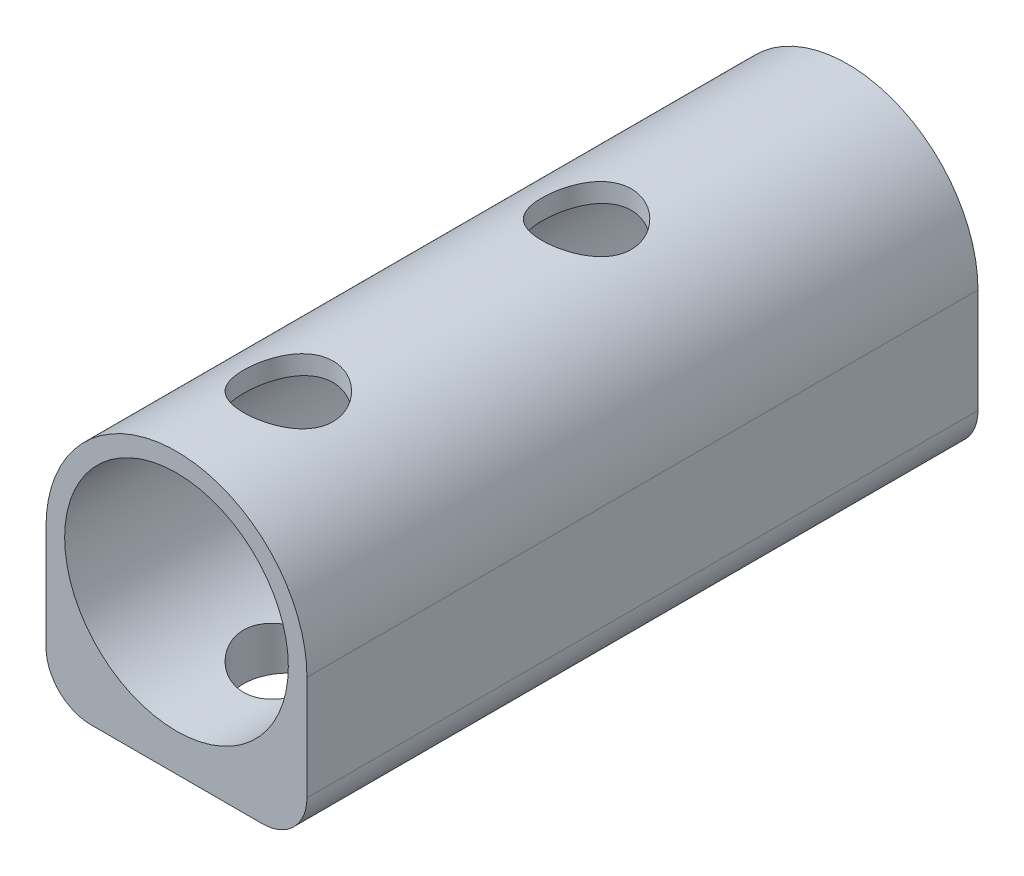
ISO-10303-21;
HEADER;
FILE_DESCRIPTION(('STEP AP214'),'2;1');
FILE_NAME('part.step','',(''),(''),'','','');
FILE_SCHEMA(('AUTOMOTIVE_DESIGN { 1 0 10303 214 1 1 1 1 }'));
ENDSEC;
DATA;
#1=APPLICATION_CONTEXT('core data for automotive mechanical design processes');
#2=APPLICATION_PROTOCOL_DEFINITION('international standard','automotive_design',2000,#1);
#3=PRODUCT_CONTEXT('',#1,'mechanical');
#4=PRODUCT('Part','Part','',(#3));
#5=PRODUCT_RELATED_PRODUCT_CATEGORY('part','',(#4));
#6=PRODUCT_DEFINITION_FORMATION('','',#4);
#7=PRODUCT_DEFINITION_CONTEXT('part definition',#1,'design');
#8=PRODUCT_DEFINITION('design','',#6,#7);
#9=PRODUCT_DEFINITION_SHAPE('','',#8);
#10=(LENGTH_UNIT() NAMED_UNIT(*) SI_UNIT(.MILLI.,.METRE.));
#11=(NAMED_UNIT(*) PLANE_ANGLE_UNIT() SI_UNIT($,.RADIAN.));
#12=(NAMED_UNIT(*) SI_UNIT($,.STERADIAN.) SOLID_ANGLE_UNIT());
#13=UNCERTAINTY_MEASURE_WITH_UNIT(LENGTH_MEASURE(1.E-05),#10,'distance_accuracy_value','');
#14=(GEOMETRIC_REPRESENTATION_CONTEXT(3) GLOBAL_UNCERTAINTY_ASSIGNED_CONTEXT((#13)) GLOBAL_UNIT_ASSIGNED_CONTEXT((#10,
#11,#12)) REPRESENTATION_CONTEXT('',''));
#15=CARTESIAN_POINT('',(0.,0.,0.));
#16=DIRECTION('',(0.,0.,1.));
#17=DIRECTION('',(1.,0.,0.));
#18=AXIS2_PLACEMENT_3D('',#15,#16,#17);
#19=CARTESIAN_POINT('',(17.5,-20.,90.));
#20=DIRECTION('',(0.,-1.,0.));
#21=DIRECTION('',(1.,0.,0.));
#22=AXIS2_PLACEMENT_3D('',#19,#20,#21);
#23=PLANE('',#22);
#24=CARTESIAN_POINT('',(0.,-20.,75.));
#25=DIRECTION('',(0.,-1.,0.));
#26=DIRECTION('',(1.,0.,0.));
#27=AXIS2_PLACEMENT_3D('',#24,#25,#26);
#28=CIRCLE('',#27,6.);
#29=CARTESIAN_POINT('',(6.,-20.,75.));
#30=VERTEX_POINT('',#29);
#31=EDGE_CURVE('E177',#30,#30,#28,.T.);
#32=ORIENTED_EDGE('',*,*,#31,.F.);
#33=EDGE_LOOP('',(#32));
#34=FACE_BOUND('',#33,.T.);
#35=CARTESIAN_POINT('',(0.,-20.,35.));
#36=DIRECTION('',(0.,-1.,0.));
#37=DIRECTION('',(1.,0.,0.));
#38=AXIS2_PLACEMENT_3D('',#35,#36,#37);
#39=CIRCLE('',#38,6.);
#40=CARTESIAN_POINT('',(6.,-20.,35.));
#41=VERTEX_POINT('',#40);
#42=EDGE_CURVE('E130',#41,#41,#39,.T.);
#43=ORIENTED_EDGE('',*,*,#42,.F.);
#44=EDGE_LOOP('',(#43));
#45=FACE_BOUND('',#44,.T.);
#46=DIRECTION('',(-1.,0.,0.));
#47=VECTOR('',#46,1.);
#48=CARTESIAN_POINT('',(17.5,-20.,90.));
#49=LINE('',#48,#47);
#50=CARTESIAN_POINT('',(11.5,-20.,90.));
#51=VERTEX_POINT('',#50);
#52=CARTESIAN_POINT('',(-11.5,-20.,90.));
#53=VERTEX_POINT('',#52);
#54=EDGE_CURVE('E94',#51,#53,#49,.T.);
#55=ORIENTED_EDGE('',*,*,#54,.T.);
#56=DIRECTION('',(0.,0.,-1.));
#57=VECTOR('',#56,1.);
#58=CARTESIAN_POINT('',(-11.5,-20.,90.));
#59=LINE('',#58,#57);
#60=CARTESIAN_POINT('',(-11.5,-20.,0.));
#61=VERTEX_POINT('',#60);
#62=EDGE_CURVE('E195',#53,#61,#59,.T.);
#63=ORIENTED_EDGE('',*,*,#62,.T.);
#64=DIRECTION('',(-1.,0.,0.));
#65=VECTOR('',#64,1.);
#66=CARTESIAN_POINT('',(17.5,-20.,0.));
#67=LINE('',#66,#65);
#68=CARTESIAN_POINT('',(11.5,-20.,0.));
#69=VERTEX_POINT('',#68);
#70=EDGE_CURVE('E109',#69,#61,#67,.T.);
#71=ORIENTED_EDGE('',*,*,#70,.F.);
#72=DIRECTION('',(0.,0.,-1.));
#73=VECTOR('',#72,1.);
#74=CARTESIAN_POINT('',(11.5,-20.,90.));
#75=LINE('',#74,#73);
#76=EDGE_CURVE('E119',#69,#51,#75,.F.);
#77=ORIENTED_EDGE('',*,*,#76,.T.);
#78=EDGE_LOOP('',(#55,#63,#71,#77));
#79=FACE_BOUND('',#78,.T.);
#80=ADVANCED_FACE('F32',(#34,#45,#79),#23,.T.);
#81=CARTESIAN_POINT('',(17.5,0.,90.));
#82=DIRECTION('',(1.,0.,0.));
#83=DIRECTION('',(0.,0.,-1.));
#84=AXIS2_PLACEMENT_3D('',#81,#82,#83);
#85=PLANE('',#84);
#86=DIRECTION('',(0.,-1.,0.));
#87=VECTOR('',#86,1.);
#88=CARTESIAN_POINT('',(17.5,0.,90.));
#89=LINE('',#88,#87);
#90=CARTESIAN_POINT('',(17.5,0.,90.));
#91=VERTEX_POINT('',#90);
#92=CARTESIAN_POINT('',(17.5,-14.,90.));
#93=VERTEX_POINT('',#92);
#94=EDGE_CURVE('E102',#91,#93,#89,.T.);
#95=ORIENTED_EDGE('',*,*,#94,.T.);
#96=DIRECTION('',(0.,0.,-1.));
#97=VECTOR('',#96,1.);
#98=CARTESIAN_POINT('',(17.5,-14.,90.));
#99=LINE('',#98,#97);
#100=CARTESIAN_POINT('',(17.5,-14.,0.));
#101=VERTEX_POINT('',#100);
#102=EDGE_CURVE('E11',#93,#101,#99,.T.);
#103=ORIENTED_EDGE('',*,*,#102,.T.);
#104=DIRECTION('',(0.,-1.,0.));
#105=VECTOR('',#104,1.);
#106=CARTESIAN_POINT('',(17.5,0.,0.));
#107=LINE('',#106,#105);
#108=CARTESIAN_POINT('',(17.5,0.,0.));
#109=VERTEX_POINT('',#108);
#110=EDGE_CURVE('E116',#109,#101,#107,.T.);
#111=ORIENTED_EDGE('',*,*,#110,.F.);
#112=DIRECTION('',(0.,0.,-1.));
#113=VECTOR('',#112,1.);
#114=CARTESIAN_POINT('',(17.5,0.,90.));
#115=LINE('',#114,#113);
#116=EDGE_CURVE('E101',#91,#109,#115,.T.);
#117=ORIENTED_EDGE('',*,*,#116,.F.);
#118=EDGE_LOOP('',(#95,#103,#111,#117));
#119=FACE_BOUND('',#118,.T.);
#120=ADVANCED_FACE('F165',(#119),#85,.T.);
#121=CARTESIAN_POINT('',(0.,0.,90.));
#122=DIRECTION('',(0.,0.,-1.));
#123=DIRECTION('',(-1.,0.,0.));
#124=AXIS2_PLACEMENT_3D('',#121,#122,#123);
#125=CYLINDRICAL_SURFACE('',#124,17.5);
#126=CARTESIAN_POINT('',(0.,17.5,69.));
#127=CARTESIAN_POINT('',(-0.163389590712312,17.5000001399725,68.999999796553));
#128=CARTESIAN_POINT('',(-0.326776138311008,17.4977065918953,69.0066793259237));
#129=CARTESIAN_POINT('',(-0.652391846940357,17.488594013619,69.0333361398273));
#130=CARTESIAN_POINT('',(-0.814620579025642,17.4817733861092,69.0533181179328));
#131=CARTESIAN_POINT('',(-1.13661475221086,17.4637940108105,69.1063828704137));
#132=CARTESIAN_POINT('',(-1.29638103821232,17.452636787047,69.139461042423));
#133=CARTESIAN_POINT('',(-1.61243727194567,17.4262791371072,69.2184267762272));
#134=CARTESIAN_POINT('',(-1.76872584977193,17.4110771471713,69.2643192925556));
#135=CARTESIAN_POINT('',(-2.07636915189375,17.3770708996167,69.3683923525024));
#136=CARTESIAN_POINT('',(-2.22773376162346,17.3582744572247,69.4265462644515));
#137=CARTESIAN_POINT('',(-2.52496271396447,17.3175366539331,69.5547479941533));
#138=CARTESIAN_POINT('',(-2.6708249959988,17.2955941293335,69.624800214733));
#139=CARTESIAN_POINT('',(-2.95607249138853,17.2491308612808,69.7762364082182));
#140=CARTESIAN_POINT('',(-3.09545894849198,17.2246106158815,69.8576181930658));
#141=CARTESIAN_POINT('',(-3.36702141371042,17.1735920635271,70.0311826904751));
#142=CARTESIAN_POINT('',(-3.49919480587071,17.1470930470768,70.1233692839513));
#143=CARTESIAN_POINT('',(-3.75971990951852,17.091893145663,70.3210990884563));
#144=CARTESIAN_POINT('',(-3.88780616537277,17.0631486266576,70.4269799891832));
#145=CARTESIAN_POINT('',(-4.13468315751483,17.0050134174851,70.6489141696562));
#146=CARTESIAN_POINT('',(-4.25347367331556,16.9756227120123,70.7649676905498));
#147=CARTESIAN_POINT('',(-4.48109269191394,16.9169627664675,71.0065846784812));
#148=CARTESIAN_POINT('',(-4.58991719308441,16.8876935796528,71.1321519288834));
#149=CARTESIAN_POINT('',(-4.79683730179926,16.8300886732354,71.3919641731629));
#150=CARTESIAN_POINT('',(-4.89493656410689,16.8017526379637,71.5262061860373));
#151=CARTESIAN_POINT('',(-5.08268823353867,16.7459300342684,71.8069332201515));
#152=CARTESIAN_POINT('',(-5.17198146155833,16.7184975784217,71.9536695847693));
#153=CARTESIAN_POINT('',(-5.33779870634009,16.6662971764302,72.2545672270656));
#154=CARTESIAN_POINT('',(-5.41432777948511,16.641528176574,72.4087255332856));
#155=CARTESIAN_POINT('',(-5.55403069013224,16.5954258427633,72.7235118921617));
#156=CARTESIAN_POINT('',(-5.61720233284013,16.5740930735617,72.8841410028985));
#157=CARTESIAN_POINT('',(-5.72956595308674,16.5355860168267,73.2106253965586));
#158=CARTESIAN_POINT('',(-5.77876437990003,16.5184098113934,73.3764782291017));
#159=CARTESIAN_POINT('',(-5.8612571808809,16.4893150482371,73.706342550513));
#160=CARTESIAN_POINT('',(-5.89504746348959,16.4772336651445,73.8702156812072));
#161=CARTESIAN_POINT('',(-5.94883595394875,16.4578908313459,74.2004254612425));
#162=CARTESIAN_POINT('',(-5.96883997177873,16.4506273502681,74.3667610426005));
#163=CARTESIAN_POINT('',(-5.9948669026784,16.4411606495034,74.700652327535));
#164=CARTESIAN_POINT('',(-6.00089101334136,16.4389569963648,74.8682079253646));
#165=CARTESIAN_POINT('',(-5.99889639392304,16.4396850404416,75.2032216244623));
#166=CARTESIAN_POINT('',(-5.99087809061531,16.4426165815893,75.3706797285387));
#167=CARTESIAN_POINT('',(-5.96162212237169,16.4532454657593,75.6959999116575));
#168=CARTESIAN_POINT('',(-5.94105099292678,16.4607024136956,75.853930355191));
#169=CARTESIAN_POINT('',(-5.88747410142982,16.4799410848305,76.1674538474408));
#170=CARTESIAN_POINT('',(-5.8544641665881,16.4917242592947,76.323046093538));
#171=CARTESIAN_POINT('',(-5.77631897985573,16.5192569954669,76.6307452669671));
#172=CARTESIAN_POINT('',(-5.73118707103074,16.5350054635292,76.7828531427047));
#173=CARTESIAN_POINT('',(-5.62915620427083,16.5700183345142,77.082712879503));
#174=CARTESIAN_POINT('',(-5.57225277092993,16.5892840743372,77.230463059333));
#175=CARTESIAN_POINT('',(-5.44610761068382,16.6311273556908,77.5230347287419));
#176=CARTESIAN_POINT('',(-5.37667900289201,16.6537539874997,77.6677685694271));
#177=CARTESIAN_POINT('',(-5.22662395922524,16.7014549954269,77.9509471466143));
#178=CARTESIAN_POINT('',(-5.14599370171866,16.726530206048,78.0893897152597));
#179=CARTESIAN_POINT('',(-4.97409227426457,16.7784524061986,78.3591651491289));
#180=CARTESIAN_POINT('',(-4.88282026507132,16.8052995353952,78.4904974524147));
#181=CARTESIAN_POINT('',(-4.69020928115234,16.8600699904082,78.7453235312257));
#182=CARTESIAN_POINT('',(-4.58886992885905,16.887993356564,78.8688170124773));
#183=CARTESIAN_POINT('',(-4.37080702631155,16.9457800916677,79.1139311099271));
#184=CARTESIAN_POINT('',(-4.25354109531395,16.9756649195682,79.235064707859));
#185=CARTESIAN_POINT('',(-4.00922102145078,17.0350210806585,79.4670478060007));
#186=CARTESIAN_POINT('',(-3.88216995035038,17.0644925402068,79.5779005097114));
#187=CARTESIAN_POINT('',(-3.61895574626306,17.1222463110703,79.7886950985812));
#188=CARTESIAN_POINT('',(-3.4827882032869,17.1505280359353,79.8886316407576));
#189=CARTESIAN_POINT('',(-3.20229046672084,17.2051079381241,80.0767947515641));
#190=CARTESIAN_POINT('',(-3.0579635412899,17.2314068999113,80.1650259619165));
#191=CARTESIAN_POINT('',(-2.76030824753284,17.2816010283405,80.3301022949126));
#192=CARTESIAN_POINT('',(-2.60689547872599,17.3054650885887,80.4068048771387));
#193=CARTESIAN_POINT('',(-2.29370601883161,17.3497524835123,80.5469207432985));
#194=CARTESIAN_POINT('',(-2.13393183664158,17.3701771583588,80.6103392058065));
#195=CARTESIAN_POINT('',(-1.80912555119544,17.4070035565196,80.7233406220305));
#196=CARTESIAN_POINT('',(-1.64409395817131,17.423405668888,80.7729249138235));
#197=CARTESIAN_POINT('',(-1.31001358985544,17.4517036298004,80.8577779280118));
#198=CARTESIAN_POINT('',(-1.14096501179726,17.4635996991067,80.8930473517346));
#199=CARTESIAN_POINT('',(-0.807961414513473,17.4820974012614,80.9476345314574));
#200=CARTESIAN_POINT('',(-0.644125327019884,17.4889155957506,80.9676059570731));
#201=CARTESIAN_POINT('',(-0.315240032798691,17.4979336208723,80.9939833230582));
#202=CARTESIAN_POINT('',(-0.150190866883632,17.5001336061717,81.0003897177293));
#203=CARTESIAN_POINT('',(0.17984260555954,17.4998538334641,80.9995736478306));
#204=CARTESIAN_POINT('',(0.344826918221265,17.497374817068,80.9923533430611));
#205=CARTESIAN_POINT('',(0.67350505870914,17.487807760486,80.9643602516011));
#206=CARTESIAN_POINT('',(0.837198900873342,17.4807197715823,80.9435876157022));
#207=CARTESIAN_POINT('',(1.15699915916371,17.4624226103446,80.8895523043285));
#208=CARTESIAN_POINT('',(1.31318291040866,17.4513489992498,80.8566997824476));
#209=CARTESIAN_POINT('',(1.62218787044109,17.4253423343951,80.7787459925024));
#210=CARTESIAN_POINT('',(1.77500794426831,17.4104079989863,80.7336406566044));
#211=CARTESIAN_POINT('',(2.07619695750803,17.3770641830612,80.6315791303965));
#212=CARTESIAN_POINT('',(2.2245670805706,17.3586556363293,80.574626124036));
#213=CARTESIAN_POINT('',(2.51603746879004,17.31881065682,80.4492873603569));
#214=CARTESIAN_POINT('',(2.65913571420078,17.2973730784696,80.3808972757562));
#215=CARTESIAN_POINT('',(2.94291064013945,17.2513908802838,80.2312228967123));
#216=CARTESIAN_POINT('',(3.08342026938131,17.2267785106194,80.1496427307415));
#217=CARTESIAN_POINT('',(3.3571528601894,17.1755327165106,79.9755248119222));
#218=CARTESIAN_POINT('',(3.49037328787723,17.1488985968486,79.8829832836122));
#219=CARTESIAN_POINT('',(3.74873071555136,17.0942813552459,79.687563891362));
#220=CARTESIAN_POINT('',(3.87386683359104,17.0662980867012,79.5846849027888));
#221=CARTESIAN_POINT('',(4.11533777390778,17.0096848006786,79.3692309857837));
#222=CARTESIAN_POINT('',(4.23167234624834,16.9810547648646,79.2566557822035));
#223=CARTESIAN_POINT('',(4.46028931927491,16.922482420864,79.0167874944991));
#224=CARTESIAN_POINT('',(4.57210228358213,16.892543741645,78.8890455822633));
#225=CARTESIAN_POINT('',(4.78456373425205,16.8336004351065,78.6244623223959));
#226=CARTESIAN_POINT('',(4.8852158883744,16.8045955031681,78.4876239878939));
#227=CARTESIAN_POINT('',(5.07474821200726,16.7483345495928,78.2055901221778));
#228=CARTESIAN_POINT('',(5.16362325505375,16.7210792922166,78.0603909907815));
#229=CARTESIAN_POINT('',(5.32884966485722,16.6691589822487,77.7626676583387));
#230=CARTESIAN_POINT('',(5.40520626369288,16.6444928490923,77.6101465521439));
#231=CARTESIAN_POINT('',(5.54478306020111,16.598517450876,77.2987977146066));
#232=CARTESIAN_POINT('',(5.6080091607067,16.5772066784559,77.1399728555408));
#233=CARTESIAN_POINT('',(5.72077524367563,16.5386300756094,76.8171275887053));
#234=CARTESIAN_POINT('',(5.77032089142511,16.5213625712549,76.6531093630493));
#235=CARTESIAN_POINT('',(5.85526622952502,16.4914489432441,76.3210668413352));
#236=CARTESIAN_POINT('',(5.8906687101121,16.47880190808,76.1530433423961));
#237=CARTESIAN_POINT('',(5.94696706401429,16.4585686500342,75.8142846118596));
#238=CARTESIAN_POINT('',(5.96786372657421,16.4509821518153,75.6435495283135));
#239=CARTESIAN_POINT('',(5.9941854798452,16.4414087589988,75.3101098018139));
#240=CARTESIAN_POINT('',(6.00039147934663,16.4391393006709,75.1474744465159));
#241=CARTESIAN_POINT('',(5.99957016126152,16.4394391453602,74.8221837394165));
#242=CARTESIAN_POINT('',(5.99253835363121,16.4420100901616,74.6595283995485));
#243=CARTESIAN_POINT('',(5.96530939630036,16.4519084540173,74.3355451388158));
#244=CARTESIAN_POINT('',(5.94511808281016,16.4592337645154,74.1742166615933));
#245=CARTESIAN_POINT('',(5.89176501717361,16.478407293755,73.8539318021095));
#246=CARTESIAN_POINT('',(5.85859839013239,16.4902572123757,73.6949763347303));
#247=CARTESIAN_POINT('',(5.78046684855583,16.5178048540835,73.3840353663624));
#248=CARTESIAN_POINT('',(5.73577376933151,16.5334134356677,73.2319734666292));
#249=CARTESIAN_POINT('',(5.63463461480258,16.5681547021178,72.9321676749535));
#250=CARTESIAN_POINT('',(5.57818438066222,16.5872886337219,72.7844253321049));
#251=CARTESIAN_POINT('',(5.45399262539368,16.6285369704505,72.4942326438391));
#252=CARTESIAN_POINT('',(5.38625307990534,16.6506508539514,72.3517813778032));
#253=CARTESIAN_POINT('',(5.23993629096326,16.6972741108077,72.0729070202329));
#254=CARTESIAN_POINT('',(5.16135514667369,16.7217843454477,71.9364861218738));
#255=CARTESIAN_POINT('',(4.99007439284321,16.773715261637,71.6644100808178));
#256=CARTESIAN_POINT('',(4.89689494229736,16.8012176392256,71.5290724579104));
#257=CARTESIAN_POINT('',(4.69988721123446,16.8573885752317,71.2666390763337));
#258=CARTESIAN_POINT('',(4.5960585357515,16.8860571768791,71.1395436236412));
#259=CARTESIAN_POINT('',(4.37834895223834,16.943811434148,70.8942772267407));
#260=CARTESIAN_POINT('',(4.26446377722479,16.9728972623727,70.7761101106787));
#261=CARTESIAN_POINT('',(4.02739221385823,17.0307073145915,70.5494951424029));
#262=CARTESIAN_POINT('',(3.90420885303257,17.0594316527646,70.4410441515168));
#263=CARTESIAN_POINT('',(3.6437822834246,17.1169909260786,70.2300824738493));
#264=CARTESIAN_POINT('',(3.50616368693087,17.1457784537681,70.1280215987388));
#265=CARTESIAN_POINT('',(3.22247595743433,17.2013525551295,69.9359123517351));
#266=CARTESIAN_POINT('',(3.07641000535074,17.2281398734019,69.8458594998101));
#267=CARTESIAN_POINT('',(2.77668905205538,17.2789786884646,69.6783955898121));
#268=CARTESIAN_POINT('',(2.62303200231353,17.3030294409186,69.6009879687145));
#269=CARTESIAN_POINT('',(2.30928262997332,17.3476887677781,69.4595297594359));
#270=CARTESIAN_POINT('',(2.14919319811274,17.3682988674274,69.3954732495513));
#271=CARTESIAN_POINT('',(1.827767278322,17.405021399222,69.2826980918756));
#272=CARTESIAN_POINT('',(1.66656335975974,17.4212338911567,69.2336342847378));
#273=CARTESIAN_POINT('',(1.34030929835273,17.4493657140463,69.1491923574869));
#274=CARTESIAN_POINT('',(1.1752607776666,17.4612868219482,69.1138085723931));
#275=CARTESIAN_POINT('',(0.84251523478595,17.4805016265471,69.0570502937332));
#276=CARTESIAN_POINT('',(0.674818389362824,17.4877956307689,69.0356748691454));
#277=CARTESIAN_POINT('',(0.338079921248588,17.4975446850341,69.0071500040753));
#278=CARTESIAN_POINT('',(0.169038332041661,17.4999998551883,69.0000002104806));
#279=CARTESIAN_POINT('',(0.,17.5,69.));
#280=B_SPLINE_CURVE_WITH_KNOTS('',3,(#126,#127,#128,#129,#130,#131,#132,#133,#134,#135,#136,
#137,#138,#139,#140,#141,#142,#143,#144,#145,#146,#147,#148,#149,#150,#151,#152,#153,#154,#155,
#156,#157,#158,#159,#160,#161,#162,#163,#164,#165,#166,#167,#168,#169,#170,#171,#172,#173,#174,
#175,#176,#177,#178,#179,#180,#181,#182,#183,#184,#185,#186,#187,#188,#189,#190,#191,#192,#193,
#194,#195,#196,#197,#198,#199,#200,#201,#202,#203,#204,#205,#206,#207,#208,#209,#210,#211,#212,
#213,#214,#215,#216,#217,#218,#219,#220,#221,#222,#223,#224,#225,#226,#227,#228,#229,#230,#231,
#232,#233,#234,#235,#236,#237,#238,#239,#240,#241,#242,#243,#244,#245,#246,#247,#248,#249,#250,
#251,#252,#253,#254,#255,#256,#257,#258,#259,#260,#261,#262,#263,#264,#265,#266,#267,#268,#269,
#270,#271,#272,#273,#274,#275,#276,#277,#278,#279),.UNSPECIFIED.,.T.,.F.,(4,2,2,2,2,2,2,2,2,2,2,
2,2,2,2,2,2,2,2,2,2,2,2,2,2,2,2,2,2,2,2,2,2,2,2,2,2,2,2,2,2,2,2,2,2,2,2,2,2,2,2,2,2,2,2,2,2,2,2,
2,2,2,2,2,2,2,2,2,2,2,2,2,2,2,2,2,4),(0.,0.490011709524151,0.980196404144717,1.47020898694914,
1.9604112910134,2.44955964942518,2.93888940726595,3.42812479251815,3.91753644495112,
4.4229186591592,4.92831285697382,5.43390910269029,5.93933251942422,6.4605301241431,
6.98152076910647,7.50259695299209,8.02343224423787,8.52605774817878,9.0284712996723,
9.53084181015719,10.033197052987,10.5109535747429,10.9888705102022,11.4666557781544,
11.9446230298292,12.4304215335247,12.9163861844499,13.402389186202,13.8884104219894,
14.4014894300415,14.9144080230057,15.4275765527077,15.940540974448,16.4594018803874,
16.9780601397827,17.4966682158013,18.0152508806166,18.5102019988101,19.0051365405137,
19.4999926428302,19.9948432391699,20.4742457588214,20.9538076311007,21.4332407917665,
21.9128557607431,22.4052946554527,22.8979036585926,23.3905663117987,23.8832429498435,
24.3997905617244,24.9161679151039,25.4327693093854,25.9491542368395,26.4653065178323,
26.9812447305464,27.4970811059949,28.0128894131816,28.5005949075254,28.9884658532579,
29.4761205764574,29.9639586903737,30.4412035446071,30.9186175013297,31.3959479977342,
31.8734506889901,32.3726889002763,32.8719456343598,33.3714152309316,33.870722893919,
34.3912991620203,34.9116806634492,35.4322033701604,35.9524947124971,36.459703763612,
36.9667025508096,37.4736676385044,37.9806201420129),.UNSPECIFIED.);
#281=CARTESIAN_POINT('',(0.,17.5,69.));
#282=VERTEX_POINT('',#281);
#283=EDGE_CURVE('E170',#282,#282,#280,.T.);
#284=ORIENTED_EDGE('',*,*,#283,.F.);
#285=EDGE_LOOP('',(#284));
#286=FACE_BOUND('',#285,.T.);
#287=CARTESIAN_POINT('',(0.,17.5,29.));
#288=CARTESIAN_POINT('',(-0.163389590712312,17.5000001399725,28.999999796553));
#289=CARTESIAN_POINT('',(-0.326776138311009,17.4977065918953,29.0066793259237));
#290=CARTESIAN_POINT('',(-0.652391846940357,17.488594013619,29.0333361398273));
#291=CARTESIAN_POINT('',(-0.814620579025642,17.4817733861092,29.0533181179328));
#292=CARTESIAN_POINT('',(-1.13661475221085,17.4637940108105,29.1063828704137));
#293=CARTESIAN_POINT('',(-1.29638103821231,17.452636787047,29.139461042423));
#294=CARTESIAN_POINT('',(-1.61243727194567,17.4262791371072,29.2184267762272));
#295=CARTESIAN_POINT('',(-1.76872584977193,17.4110771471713,29.2643192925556));
#296=CARTESIAN_POINT('',(-2.07636915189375,17.3770708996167,29.3683923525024));
#297=CARTESIAN_POINT('',(-2.22773376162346,17.3582744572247,29.4265462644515));
#298=CARTESIAN_POINT('',(-2.52496271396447,17.3175366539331,29.5547479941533));
#299=CARTESIAN_POINT('',(-2.67082499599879,17.2955941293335,29.624800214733));
#300=CARTESIAN_POINT('',(-2.95607249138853,17.2491308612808,29.7762364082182));
#301=CARTESIAN_POINT('',(-3.09545894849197,17.2246106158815,29.8576181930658));
#302=CARTESIAN_POINT('',(-3.36702141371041,17.1735920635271,30.0311826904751));
#303=CARTESIAN_POINT('',(-3.4991948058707,17.1470930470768,30.1233692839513));
#304=CARTESIAN_POINT('',(-3.75971990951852,17.091893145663,30.3210990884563));
#305=CARTESIAN_POINT('',(-3.88780616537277,17.0631486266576,30.4269799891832));
#306=CARTESIAN_POINT('',(-4.13468315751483,17.0050134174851,30.6489141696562));
#307=CARTESIAN_POINT('',(-4.25347367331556,16.9756227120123,30.7649676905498));
#308=CARTESIAN_POINT('',(-4.48109269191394,16.9169627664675,31.0065846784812));
#309=CARTESIAN_POINT('',(-4.58991719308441,16.8876935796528,31.1321519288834));
#310=CARTESIAN_POINT('',(-4.79683730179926,16.8300886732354,31.3919641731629));
#311=CARTESIAN_POINT('',(-4.89493656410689,16.8017526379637,31.5262061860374));
#312=CARTESIAN_POINT('',(-5.08268823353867,16.7459300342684,31.8069332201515));
#313=CARTESIAN_POINT('',(-5.17198146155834,16.7184975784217,31.9536695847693));
#314=CARTESIAN_POINT('',(-5.33779870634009,16.6662971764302,32.2545672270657));
#315=CARTESIAN_POINT('',(-5.41432777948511,16.641528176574,32.4087255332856));
#316=CARTESIAN_POINT('',(-5.55403069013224,16.5954258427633,32.7235118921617));
#317=CARTESIAN_POINT('',(-5.61720233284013,16.5740930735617,32.8841410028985));
#318=CARTESIAN_POINT('',(-5.72956595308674,16.5355860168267,33.2106253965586));
#319=CARTESIAN_POINT('',(-5.77876437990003,16.5184098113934,33.3764782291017));
#320=CARTESIAN_POINT('',(-5.8612571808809,16.4893150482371,33.706342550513));
#321=CARTESIAN_POINT('',(-5.89504746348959,16.4772336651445,33.8702156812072));
#322=CARTESIAN_POINT('',(-5.94883595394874,16.4578908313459,34.2004254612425));
#323=CARTESIAN_POINT('',(-5.96883997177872,16.4506273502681,34.3667610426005));
#324=CARTESIAN_POINT('',(-5.99486690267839,16.4411606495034,34.700652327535));
#325=CARTESIAN_POINT('',(-6.00089101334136,16.4389569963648,34.8682079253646));
#326=CARTESIAN_POINT('',(-5.99889639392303,16.4396850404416,35.2032216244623));
#327=CARTESIAN_POINT('',(-5.99087809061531,16.4426165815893,35.3706797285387));
#328=CARTESIAN_POINT('',(-5.96162212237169,16.4532454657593,35.6959999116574));
#329=CARTESIAN_POINT('',(-5.94105099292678,16.4607024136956,35.853930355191));
#330=CARTESIAN_POINT('',(-5.88747410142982,16.4799410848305,36.1674538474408));
#331=CARTESIAN_POINT('',(-5.8544641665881,16.4917242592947,36.323046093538));
#332=CARTESIAN_POINT('',(-5.77631897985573,16.5192569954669,36.6307452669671));
#333=CARTESIAN_POINT('',(-5.73118707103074,16.5350054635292,36.7828531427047));
#334=CARTESIAN_POINT('',(-5.62915620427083,16.5700183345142,37.082712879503));
#335=CARTESIAN_POINT('',(-5.57225277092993,16.5892840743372,37.230463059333));
#336=CARTESIAN_POINT('',(-5.44610761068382,16.6311273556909,37.5230347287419));
#337=CARTESIAN_POINT('',(-5.37667900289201,16.6537539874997,37.6677685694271));
#338=CARTESIAN_POINT('',(-5.22662395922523,16.7014549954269,37.9509471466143));
#339=CARTESIAN_POINT('',(-5.14599370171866,16.726530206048,38.0893897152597));
#340=CARTESIAN_POINT('',(-4.97409227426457,16.7784524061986,38.3591651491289));
#341=CARTESIAN_POINT('',(-4.88282026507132,16.8052995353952,38.4904974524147));
#342=CARTESIAN_POINT('',(-4.69020928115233,16.8600699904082,38.7453235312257));
#343=CARTESIAN_POINT('',(-4.58886992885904,16.887993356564,38.8688170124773));
#344=CARTESIAN_POINT('',(-4.37080702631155,16.9457800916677,39.1139311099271));
#345=CARTESIAN_POINT('',(-4.25354109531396,16.9756649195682,39.235064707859));
#346=CARTESIAN_POINT('',(-4.00922102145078,17.0350210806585,39.4670478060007));
#347=CARTESIAN_POINT('',(-3.88216995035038,17.0644925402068,39.5779005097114));
#348=CARTESIAN_POINT('',(-3.61895574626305,17.1222463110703,39.7886950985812));
#349=CARTESIAN_POINT('',(-3.4827882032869,17.1505280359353,39.8886316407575));
#350=CARTESIAN_POINT('',(-3.20229046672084,17.2051079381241,40.0767947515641));
#351=CARTESIAN_POINT('',(-3.05796354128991,17.2314068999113,40.1650259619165));
#352=CARTESIAN_POINT('',(-2.76030824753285,17.2816010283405,40.3301022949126));
#353=CARTESIAN_POINT('',(-2.60689547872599,17.3054650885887,40.4068048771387));
#354=CARTESIAN_POINT('',(-2.29370601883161,17.3497524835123,40.5469207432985));
#355=CARTESIAN_POINT('',(-2.13393183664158,17.3701771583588,40.6103392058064));
#356=CARTESIAN_POINT('',(-1.80912555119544,17.4070035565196,40.7233406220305));
#357=CARTESIAN_POINT('',(-1.6440939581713,17.423405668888,40.7729249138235));
#358=CARTESIAN_POINT('',(-1.31001358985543,17.4517036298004,40.8577779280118));
#359=CARTESIAN_POINT('',(-1.14096501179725,17.4635996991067,40.8930473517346));
#360=CARTESIAN_POINT('',(-0.807961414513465,17.4820974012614,40.9476345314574));
#361=CARTESIAN_POINT('',(-0.644125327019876,17.4889155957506,40.9676059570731));
#362=CARTESIAN_POINT('',(-0.315240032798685,17.4979336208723,40.9939833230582));
#363=CARTESIAN_POINT('',(-0.150190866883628,17.5001336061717,41.0003897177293));
#364=CARTESIAN_POINT('',(0.179842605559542,17.4998538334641,40.9995736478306));
#365=CARTESIAN_POINT('',(0.344826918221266,17.497374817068,40.9923533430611));
#366=CARTESIAN_POINT('',(0.673505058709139,17.487807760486,40.9643602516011));
#367=CARTESIAN_POINT('',(0.837198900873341,17.4807197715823,40.9435876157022));
#368=CARTESIAN_POINT('',(1.15699915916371,17.4624226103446,40.8895523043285));
#369=CARTESIAN_POINT('',(1.31318291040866,17.4513489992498,40.8566997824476));
#370=CARTESIAN_POINT('',(1.62218787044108,17.4253423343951,40.7787459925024));
#371=CARTESIAN_POINT('',(1.77500794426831,17.4104079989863,40.7336406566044));
#372=CARTESIAN_POINT('',(2.07619695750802,17.3770641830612,40.6315791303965));
#373=CARTESIAN_POINT('',(2.2245670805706,17.3586556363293,40.5746261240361));
#374=CARTESIAN_POINT('',(2.51603746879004,17.31881065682,40.4492873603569));
#375=CARTESIAN_POINT('',(2.65913571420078,17.2973730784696,40.3808972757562));
#376=CARTESIAN_POINT('',(2.94291064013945,17.2513908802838,40.2312228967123));
#377=CARTESIAN_POINT('',(3.0834202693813,17.2267785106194,40.1496427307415));
#378=CARTESIAN_POINT('',(3.35715286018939,17.1755327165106,39.9755248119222));
#379=CARTESIAN_POINT('',(3.49037328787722,17.1488985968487,39.8829832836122));
#380=CARTESIAN_POINT('',(3.74873071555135,17.0942813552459,39.687563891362));
#381=CARTESIAN_POINT('',(3.87386683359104,17.0662980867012,39.5846849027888));
#382=CARTESIAN_POINT('',(4.11533777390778,17.0096848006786,39.3692309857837));
#383=CARTESIAN_POINT('',(4.23167234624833,16.9810547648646,39.2566557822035));
#384=CARTESIAN_POINT('',(4.46028931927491,16.922482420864,39.0167874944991));
#385=CARTESIAN_POINT('',(4.57210228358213,16.892543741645,38.8890455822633));
#386=CARTESIAN_POINT('',(4.78456373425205,16.8336004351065,38.6244623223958));
#387=CARTESIAN_POINT('',(4.88521588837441,16.8045955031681,38.4876239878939));
#388=CARTESIAN_POINT('',(5.07474821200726,16.7483345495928,38.2055901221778));
#389=CARTESIAN_POINT('',(5.16362325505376,16.7210792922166,38.0603909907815));
#390=CARTESIAN_POINT('',(5.32884966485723,16.6691589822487,37.7626676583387));
#391=CARTESIAN_POINT('',(5.40520626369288,16.6444928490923,37.6101465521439));
#392=CARTESIAN_POINT('',(5.54478306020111,16.598517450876,37.2987977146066));
#393=CARTESIAN_POINT('',(5.6080091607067,16.5772066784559,37.1399728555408));
#394=CARTESIAN_POINT('',(5.72077524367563,16.5386300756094,36.8171275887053));
#395=CARTESIAN_POINT('',(5.77032089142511,16.5213625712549,36.6531093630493));
#396=CARTESIAN_POINT('',(5.85526622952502,16.4914489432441,36.3210668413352));
#397=CARTESIAN_POINT('',(5.8906687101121,16.47880190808,36.1530433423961));
#398=CARTESIAN_POINT('',(5.94696706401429,16.4585686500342,35.8142846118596));
#399=CARTESIAN_POINT('',(5.96786372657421,16.4509821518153,35.6435495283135));
#400=CARTESIAN_POINT('',(5.9941854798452,16.4414087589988,35.3101098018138));
#401=CARTESIAN_POINT('',(6.00039147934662,16.4391393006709,35.1474744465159));
#402=CARTESIAN_POINT('',(5.99957016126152,16.4394391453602,34.8221837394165));
#403=CARTESIAN_POINT('',(5.99253835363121,16.4420100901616,34.6595283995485));
#404=CARTESIAN_POINT('',(5.96530939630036,16.4519084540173,34.3355451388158));
#405=CARTESIAN_POINT('',(5.94511808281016,16.4592337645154,34.1742166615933));
#406=CARTESIAN_POINT('',(5.89176501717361,16.478407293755,33.8539318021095));
#407=CARTESIAN_POINT('',(5.85859839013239,16.4902572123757,33.6949763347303));
#408=CARTESIAN_POINT('',(5.78046684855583,16.5178048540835,33.3840353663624));
#409=CARTESIAN_POINT('',(5.73577376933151,16.5334134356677,33.2319734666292));
#410=CARTESIAN_POINT('',(5.63463461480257,16.5681547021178,32.9321676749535));
#411=CARTESIAN_POINT('',(5.57818438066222,16.5872886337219,32.7844253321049));
#412=CARTESIAN_POINT('',(5.45399262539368,16.6285369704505,32.4942326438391));
#413=CARTESIAN_POINT('',(5.38625307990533,16.6506508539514,32.3517813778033));
#414=CARTESIAN_POINT('',(5.23993629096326,16.6972741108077,32.0729070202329));
#415=CARTESIAN_POINT('',(5.16135514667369,16.7217843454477,31.9364861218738));
#416=CARTESIAN_POINT('',(4.99007439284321,16.773715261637,31.6644100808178));
#417=CARTESIAN_POINT('',(4.89689494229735,16.8012176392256,31.5290724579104));
#418=CARTESIAN_POINT('',(4.69988721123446,16.8573885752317,31.2666390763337));
#419=CARTESIAN_POINT('',(4.59605853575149,16.8860571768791,31.1395436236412));
#420=CARTESIAN_POINT('',(4.37834895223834,16.943811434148,30.8942772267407));
#421=CARTESIAN_POINT('',(4.26446377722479,16.9728972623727,30.7761101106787));
#422=CARTESIAN_POINT('',(4.02739221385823,17.0307073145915,30.5494951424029));
#423=CARTESIAN_POINT('',(3.90420885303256,17.0594316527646,30.4410441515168));
#424=CARTESIAN_POINT('',(3.64378228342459,17.1169909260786,30.2300824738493));
#425=CARTESIAN_POINT('',(3.50616368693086,17.1457784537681,30.1280215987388));
#426=CARTESIAN_POINT('',(3.22247595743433,17.2013525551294,29.9359123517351));
#427=CARTESIAN_POINT('',(3.07641000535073,17.2281398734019,29.8458594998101));
#428=CARTESIAN_POINT('',(2.77668905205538,17.2789786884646,29.678395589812));
#429=CARTESIAN_POINT('',(2.62303200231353,17.3030294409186,29.6009879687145));
#430=CARTESIAN_POINT('',(2.30928262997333,17.3476887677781,29.4595297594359));
#431=CARTESIAN_POINT('',(2.14919319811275,17.3682988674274,29.3954732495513));
#432=CARTESIAN_POINT('',(1.827767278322,17.405021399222,29.2826980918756));
#433=CARTESIAN_POINT('',(1.66656335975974,17.4212338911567,29.2336342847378));
#434=CARTESIAN_POINT('',(1.34030929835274,17.4493657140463,29.1491923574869));
#435=CARTESIAN_POINT('',(1.17526077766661,17.4612868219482,29.1138085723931));
#436=CARTESIAN_POINT('',(0.842515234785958,17.4805016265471,29.0570502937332));
#437=CARTESIAN_POINT('',(0.674818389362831,17.4877956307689,29.0356748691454));
#438=CARTESIAN_POINT('',(0.338079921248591,17.4975446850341,29.0071500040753));
#439=CARTESIAN_POINT('',(0.169038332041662,17.4999998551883,29.0000002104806));
#440=CARTESIAN_POINT('',(0.,17.5,29.));
#441=B_SPLINE_CURVE_WITH_KNOTS('',3,(#287,#288,#289,#290,#291,#292,#293,#294,#295,#296,#297,
#298,#299,#300,#301,#302,#303,#304,#305,#306,#307,#308,#309,#310,#311,#312,#313,#314,#315,#316,
#317,#318,#319,#320,#321,#322,#323,#324,#325,#326,#327,#328,#329,#330,#331,#332,#333,#334,#335,
#336,#337,#338,#339,#340,#341,#342,#343,#344,#345,#346,#347,#348,#349,#350,#351,#352,#353,#354,
#355,#356,#357,#358,#359,#360,#361,#362,#363,#364,#365,#366,#367,#368,#369,#370,#371,#372,#373,
#374,#375,#376,#377,#378,#379,#380,#381,#382,#383,#384,#385,#386,#387,#388,#389,#390,#391,#392,
#393,#394,#395,#396,#397,#398,#399,#400,#401,#402,#403,#404,#405,#406,#407,#408,#409,#410,#411,
#412,#413,#414,#415,#416,#417,#418,#419,#420,#421,#422,#423,#424,#425,#426,#427,#428,#429,#430,
#431,#432,#433,#434,#435,#436,#437,#438,#439,#440),.UNSPECIFIED.,.T.,.F.,(4,2,2,2,2,2,2,2,2,2,2,
2,2,2,2,2,2,2,2,2,2,2,2,2,2,2,2,2,2,2,2,2,2,2,2,2,2,2,2,2,2,2,2,2,2,2,2,2,2,2,2,2,2,2,2,2,2,2,2,
2,2,2,2,2,2,2,2,2,2,2,2,2,2,2,2,2,4),(0.,0.490011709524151,0.980196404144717,1.47020898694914,
1.96041129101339,2.44955964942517,2.93888940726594,3.42812479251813,3.91753644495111,
4.4229186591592,4.92831285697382,5.4339091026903,5.93933251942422,6.4605301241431,
6.98152076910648,7.50259695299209,8.02343224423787,8.52605774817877,9.02847129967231,
9.53084181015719,10.033197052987,10.5109535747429,10.9888705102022,11.4666557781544,
11.9446230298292,12.4304215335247,12.9163861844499,13.402389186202,13.8884104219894,
14.4014894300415,14.9144080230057,15.4275765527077,15.940540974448,16.4594018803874,
16.9780601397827,17.4966682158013,18.0152508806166,18.5102019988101,19.0051365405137,
19.4999926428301,19.9948432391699,20.4742457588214,20.9538076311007,21.4332407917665,
21.9128557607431,22.4052946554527,22.8979036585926,23.3905663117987,23.8832429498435,
24.3997905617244,24.9161679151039,25.4327693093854,25.9491542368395,26.4653065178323,
26.9812447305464,27.4970811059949,28.0128894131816,28.5005949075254,28.9884658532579,
29.4761205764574,29.9639586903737,30.4412035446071,30.9186175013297,31.3959479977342,
31.8734506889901,32.3726889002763,32.8719456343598,33.3714152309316,33.870722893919,
34.3912991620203,34.9116806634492,35.4322033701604,35.9524947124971,36.459703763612,
36.9667025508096,37.4736676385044,37.9806201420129),.UNSPECIFIED.);
#442=CARTESIAN_POINT('',(0.,17.5,29.));
#443=VERTEX_POINT('',#442);
#444=EDGE_CURVE('E150',#443,#443,#441,.T.);
#445=ORIENTED_EDGE('',*,*,#444,.F.);
#446=EDGE_LOOP('',(#445));
#447=FACE_BOUND('',#446,.T.);
#448=CARTESIAN_POINT('',(0.,0.,0.));
#449=DIRECTION('',(0.,0.,-1.));
#450=DIRECTION('',(-1.,0.,0.));
#451=AXIS2_PLACEMENT_3D('',#448,#449,#450);
#452=CIRCLE('',#451,17.5);
#453=CARTESIAN_POINT('',(-17.5,0.,0.));
#454=VERTEX_POINT('',#453);
#455=EDGE_CURVE('E100',#454,#109,#452,.T.);
#456=ORIENTED_EDGE('',*,*,#455,.F.);
#457=DIRECTION('',(0.,0.,-1.));
#458=VECTOR('',#457,1.);
#459=CARTESIAN_POINT('',(-17.5,0.,90.));
#460=LINE('',#459,#458);
#461=CARTESIAN_POINT('',(-17.5,0.,90.));
#462=VERTEX_POINT('',#461);
#463=EDGE_CURVE('E89',#462,#454,#460,.T.);
#464=ORIENTED_EDGE('',*,*,#463,.F.);
#465=CARTESIAN_POINT('',(0.,0.,90.));
#466=DIRECTION('',(0.,0.,-1.));
#467=DIRECTION('',(-1.,0.,0.));
#468=AXIS2_PLACEMENT_3D('',#465,#466,#467);
#469=CIRCLE('',#468,17.5);
#470=EDGE_CURVE('E93',#462,#91,#469,.T.);
#471=ORIENTED_EDGE('',*,*,#470,.T.);
#472=ORIENTED_EDGE('',*,*,#116,.T.);
#473=EDGE_LOOP('',(#456,#464,#471,#472));
#474=FACE_BOUND('',#473,.T.);
#475=ADVANCED_FACE('F98',(#286,#447,#474),#125,.T.);
#476=CARTESIAN_POINT('',(-17.5,-20.,90.));
#477=DIRECTION('',(-1.,0.,0.));
#478=DIRECTION('',(0.,0.,1.));
#479=AXIS2_PLACEMENT_3D('',#476,#477,#478);
#480=PLANE('',#479);
#481=DIRECTION('',(0.,1.,0.));
#482=VECTOR('',#481,1.);
#483=CARTESIAN_POINT('',(-17.5,-20.,0.));
#484=LINE('',#483,#482);
#485=CARTESIAN_POINT('',(-17.5,-14.,0.));
#486=VERTEX_POINT('',#485);
#487=EDGE_CURVE('E112',#486,#454,#484,.T.);
#488=ORIENTED_EDGE('',*,*,#487,.F.);
#489=DIRECTION('',(0.,0.,-1.));
#490=VECTOR('',#489,1.);
#491=CARTESIAN_POINT('',(-17.5,-14.,90.));
#492=LINE('',#491,#490);
#493=CARTESIAN_POINT('',(-17.5,-14.,90.));
#494=VERTEX_POINT('',#493);
#495=EDGE_CURVE('E55',#486,#494,#492,.F.);
#496=ORIENTED_EDGE('',*,*,#495,.T.);
#497=DIRECTION('',(0.,1.,0.));
#498=VECTOR('',#497,1.);
#499=CARTESIAN_POINT('',(-17.5,-20.,90.));
#500=LINE('',#499,#498);
#501=EDGE_CURVE('E86',#494,#462,#500,.T.);
#502=ORIENTED_EDGE('',*,*,#501,.T.);
#503=ORIENTED_EDGE('',*,*,#463,.T.);
#504=EDGE_LOOP('',(#488,#496,#502,#503));
#505=FACE_BOUND('',#504,.T.);
#506=ADVANCED_FACE('F88',(#505),#480,.T.);
#507=CARTESIAN_POINT('',(0.,0.,90.));
#508=DIRECTION('',(0.,0.,-1.));
#509=DIRECTION('',(-1.,0.,0.));
#510=AXIS2_PLACEMENT_3D('',#507,#508,#509);
#511=PLANE('',#510);
#512=CARTESIAN_POINT('',(0.,0.,90.));
#513=DIRECTION('',(0.,0.,1.));
#514=DIRECTION('',(1.,0.,0.));
#515=AXIS2_PLACEMENT_3D('',#512,#513,#514);
#516=CIRCLE('',#515,15.);
#517=CARTESIAN_POINT('',(15.,0.,90.));
#518=VERTEX_POINT('',#517);
#519=EDGE_CURVE('E158',#518,#518,#516,.T.);
#520=ORIENTED_EDGE('',*,*,#519,.F.);
#521=EDGE_LOOP('',(#520));
#522=FACE_BOUND('',#521,.T.);
#523=ORIENTED_EDGE('',*,*,#501,.F.);
#524=CARTESIAN_POINT('',(-11.5,-14.,90.));
#525=DIRECTION('',(0.,0.,-1.));
#526=DIRECTION('',(-1.,0.,0.));
#527=AXIS2_PLACEMENT_3D('',#524,#525,#526);
#528=CIRCLE('',#527,6.);
#529=EDGE_CURVE('E40',#494,#53,#528,.F.);
#530=ORIENTED_EDGE('',*,*,#529,.T.);
#531=ORIENTED_EDGE('',*,*,#54,.F.);
#532=CARTESIAN_POINT('',(11.5,-14.,90.));
#533=DIRECTION('',(0.,0.,-1.));
#534=DIRECTION('',(-1.,0.,0.));
#535=AXIS2_PLACEMENT_3D('',#532,#533,#534);
#536=CIRCLE('',#535,6.);
#537=EDGE_CURVE('E47',#51,#93,#536,.F.);
#538=ORIENTED_EDGE('',*,*,#537,.T.);
#539=ORIENTED_EDGE('',*,*,#94,.F.);
#540=ORIENTED_EDGE('',*,*,#470,.F.);
#541=EDGE_LOOP('',(#523,#530,#531,#538,#539,#540));
#542=FACE_BOUND('',#541,.T.);
#543=ADVANCED_FACE('F104',(#522,#542),#511,.F.);
#544=CARTESIAN_POINT('',(0.,0.,0.));
#545=DIRECTION('',(0.,0.,-1.));
#546=DIRECTION('',(-1.,0.,0.));
#547=AXIS2_PLACEMENT_3D('',#544,#545,#546);
#548=PLANE('',#547);
#549=CARTESIAN_POINT('',(0.,0.,0.));
#550=DIRECTION('',(0.,0.,1.));
#551=DIRECTION('',(1.,0.,0.));
#552=AXIS2_PLACEMENT_3D('',#549,#550,#551);
#553=CIRCLE('',#552,15.);
#554=CARTESIAN_POINT('',(15.,0.,0.));
#555=VERTEX_POINT('',#554);
#556=EDGE_CURVE('E113',#555,#555,#553,.T.);
#557=ORIENTED_EDGE('',*,*,#556,.T.);
#558=EDGE_LOOP('',(#557));
#559=FACE_BOUND('',#558,.T.);
#560=ORIENTED_EDGE('',*,*,#70,.T.);
#561=CARTESIAN_POINT('',(-11.5,-14.,0.));
#562=DIRECTION('',(0.,0.,-1.));
#563=DIRECTION('',(-1.,0.,0.));
#564=AXIS2_PLACEMENT_3D('',#561,#562,#563);
#565=CIRCLE('',#564,6.);
#566=EDGE_CURVE('E200',#61,#486,#565,.T.);
#567=ORIENTED_EDGE('',*,*,#566,.T.);
#568=ORIENTED_EDGE('',*,*,#487,.T.);
#569=ORIENTED_EDGE('',*,*,#455,.T.);
#570=ORIENTED_EDGE('',*,*,#110,.T.);
#571=CARTESIAN_POINT('',(11.5,-14.,0.));
#572=DIRECTION('',(0.,0.,-1.));
#573=DIRECTION('',(-1.,0.,0.));
#574=AXIS2_PLACEMENT_3D('',#571,#572,#573);
#575=CIRCLE('',#574,6.);
#576=EDGE_CURVE('E198',#101,#69,#575,.T.);
#577=ORIENTED_EDGE('',*,*,#576,.T.);
#578=EDGE_LOOP('',(#560,#567,#568,#569,#570,#577));
#579=FACE_BOUND('',#578,.T.);
#580=ADVANCED_FACE('F211',(#559,#579),#548,.T.);
#581=CARTESIAN_POINT('',(0.,0.,0.));
#582=DIRECTION('',(0.,0.,1.));
#583=DIRECTION('',(1.,0.,0.));
#584=AXIS2_PLACEMENT_3D('',#581,#582,#583);
#585=CYLINDRICAL_SURFACE('',#584,15.);
#586=CARTESIAN_POINT('',(6.00000000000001,13.7477270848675,75.));
#587=CARTESIAN_POINT('',(5.99999875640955,13.7477283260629,74.8392340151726));
#588=CARTESIAN_POINT('',(5.99352975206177,13.7505565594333,74.6784188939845));
#589=CARTESIAN_POINT('',(5.96771672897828,13.7617785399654,74.3579511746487));
#590=CARTESIAN_POINT('',(5.94836482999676,13.7701756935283,74.1982993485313));
#591=CARTESIAN_POINT('',(5.8969417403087,13.7922754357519,73.8810985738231));
#592=CARTESIAN_POINT('',(5.86484520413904,13.8059885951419,73.7235544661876));
#593=CARTESIAN_POINT('',(5.78825391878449,13.8382744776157,73.411959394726));
#594=CARTESIAN_POINT('',(5.74375401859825,13.8568492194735,73.2579099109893));
#595=CARTESIAN_POINT('',(5.64299599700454,13.8981849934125,72.9550167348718));
#596=CARTESIAN_POINT('',(5.58678827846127,13.9209280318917,72.8061538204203));
#597=CARTESIAN_POINT('',(5.46298123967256,13.969977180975,72.5138254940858));
#598=CARTESIAN_POINT('',(5.39537758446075,13.9962846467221,72.3703621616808));
#599=CARTESIAN_POINT('',(5.17633416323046,14.0794173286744,71.9495188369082));
#600=CARTESIAN_POINT('',(5.00853494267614,14.1405074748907,71.6813068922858));
#601=CARTESIAN_POINT('',(4.6239115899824,14.2710405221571,71.1621407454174));
#602=CARTESIAN_POINT('',(4.40499626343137,14.340752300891,70.9128029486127));
#603=CARTESIAN_POINT('',(4.04810209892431,14.4439708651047,70.5682609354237));
#604=CARTESIAN_POINT('',(3.92429051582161,14.4781748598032,70.4582600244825));
#605=CARTESIAN_POINT('',(3.66779743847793,14.5452673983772,70.2487210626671));
#606=CARTESIAN_POINT('',(3.53511902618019,14.5781563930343,70.1491794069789));
#607=CARTESIAN_POINT('',(3.25615691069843,14.6430448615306,69.957458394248));
#608=CARTESIAN_POINT('',(3.10954147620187,14.6749563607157,69.8657318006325));
#609=CARTESIAN_POINT('',(2.80847871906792,14.7355355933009,69.6950614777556));
#610=CARTESIAN_POINT('',(2.65403441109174,14.7642045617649,69.6161128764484));
#611=CARTESIAN_POINT('',(2.33831705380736,14.8174861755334,69.4716725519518));
#612=CARTESIAN_POINT('',(2.1770447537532,14.8420992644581,69.4061793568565));
#613=CARTESIAN_POINT('',(1.8488303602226,14.8865456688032,69.289293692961));
#614=CARTESIAN_POINT('',(1.68188862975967,14.9063792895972,69.237900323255));
#615=CARTESIAN_POINT('',(1.35182764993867,14.9398371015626,69.1519042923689));
#616=CARTESIAN_POINT('',(1.18891435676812,14.9537153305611,69.1166094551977));
#617=CARTESIAN_POINT('',(0.860364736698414,14.9762104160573,69.059666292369));
#618=CARTESIAN_POINT('',(0.694728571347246,14.9848275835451,69.0380171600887));
#619=CARTESIAN_POINT('',(0.362083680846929,14.9965524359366,69.0086089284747));
#620=CARTESIAN_POINT('',(0.195075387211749,14.9996617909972,69.0008456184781));
#621=CARTESIAN_POINT('',(-0.139014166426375,15.0002858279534,68.9992853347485));
#622=CARTESIAN_POINT('',(-0.306095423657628,14.9978007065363,69.0054878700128));
#623=CARTESIAN_POINT('',(-0.62958136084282,14.9876056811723,69.0310428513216));
#624=CARTESIAN_POINT('',(-0.786056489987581,14.9801985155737,69.049633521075));
#625=CARTESIAN_POINT('',(-1.09682374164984,14.9606558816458,69.0990052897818));
#626=CARTESIAN_POINT('',(-1.25111513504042,14.9485188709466,69.1297903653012));
#627=CARTESIAN_POINT('',(-1.55636446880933,14.9198265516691,69.2032452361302));
#628=CARTESIAN_POINT('',(-1.70732347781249,14.9032726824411,69.2459111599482));
#629=CARTESIAN_POINT('',(-2.00504692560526,14.8661462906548,69.3427652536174));
#630=CARTESIAN_POINT('',(-2.15180974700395,14.8455722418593,69.3969578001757));
#631=CARTESIAN_POINT('',(-2.44232275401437,14.8005733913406,69.5172877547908));
#632=CARTESIAN_POINT('',(-2.58599723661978,14.7760965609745,69.5835886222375));
#633=CARTESIAN_POINT('',(-2.86725918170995,14.7241067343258,69.7270711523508));
#634=CARTESIAN_POINT('',(-3.00484439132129,14.696592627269,69.8042567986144));
#635=CARTESIAN_POINT('',(-3.40726603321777,14.6104618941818,70.051311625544));
#636=CARTESIAN_POINT('',(-3.66195901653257,14.5482260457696,70.2367581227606));
#637=CARTESIAN_POINT('',(-4.15437949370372,14.4156330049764,70.6580084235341));
#638=CARTESIAN_POINT('',(-4.38989525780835,14.3450108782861,70.8963190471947));
#639=CARTESIAN_POINT('',(-4.71121812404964,14.2413889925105,71.2808028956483));
#640=CARTESIAN_POINT('',(-4.81305918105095,14.2072110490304,71.4135670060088));
#641=CARTESIAN_POINT('',(-5.0054684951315,14.1405668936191,71.6874102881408));
#642=CARTESIAN_POINT('',(-5.09604089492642,14.1081000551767,71.828486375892));
#643=CARTESIAN_POINT('',(-5.2677144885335,14.0449207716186,72.1223320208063));
#644=CARTESIAN_POINT('',(-5.34846830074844,14.0142856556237,72.2753212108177));
#645=CARTESIAN_POINT('',(-5.49666677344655,13.9568252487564,72.5882359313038));
#646=CARTESIAN_POINT('',(-5.56411683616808,13.9299984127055,72.7481586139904));
#647=CARTESIAN_POINT('',(-5.68507549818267,13.8810726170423,73.0738428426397));
#648=CARTESIAN_POINT('',(-5.7385884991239,13.8589721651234,73.2396025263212));
#649=CARTESIAN_POINT('',(-5.83111405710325,13.8202977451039,73.5757494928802));
#650=CARTESIAN_POINT('',(-5.87012778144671,13.803723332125,73.7461364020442));
#651=CARTESIAN_POINT('',(-5.93126188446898,13.7775602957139,74.0796244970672));
#652=CARTESIAN_POINT('',(-5.95426866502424,13.7676067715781,74.2425349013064));
#653=CARTESIAN_POINT('',(-5.98682783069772,13.7534799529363,74.5699405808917));
#654=CARTESIAN_POINT('',(-5.9963810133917,13.7493063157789,74.7344357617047));
#655=CARTESIAN_POINT('',(-6.00192022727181,13.7468891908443,75.0636550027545));
#656=CARTESIAN_POINT('',(-5.99790972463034,13.7486441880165,75.2283789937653));
#657=CARTESIAN_POINT('',(-5.97637695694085,13.7580178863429,75.5567696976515));
#658=CARTESIAN_POINT('',(-5.95885503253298,13.7656364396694,75.7204364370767));
#659=CARTESIAN_POINT('',(-5.91189113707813,13.7858678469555,76.0361150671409));
#660=CARTESIAN_POINT('',(-5.88318889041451,13.7981698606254,76.1882578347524));
#661=CARTESIAN_POINT('',(-5.81422990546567,13.8273689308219,76.4895012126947));
#662=CARTESIAN_POINT('',(-5.77396942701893,13.8442674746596,76.6386008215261));
#663=CARTESIAN_POINT('',(-5.6822716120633,13.8821556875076,76.9327492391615));
#664=CARTESIAN_POINT('',(-5.6308364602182,13.9031445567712,77.0777988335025));
#665=CARTESIAN_POINT('',(-5.5171864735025,13.9486342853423,77.3631002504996));
#666=CARTESIAN_POINT('',(-5.45496750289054,13.9731364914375,77.5033502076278));
#667=CARTESIAN_POINT('',(-5.31751145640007,14.0260368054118,77.7837789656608));
#668=CARTESIAN_POINT('',(-5.24185178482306,14.054551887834,77.9237285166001));
#669=CARTESIAN_POINT('',(-5.07988717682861,14.1139004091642,78.1968682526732));
#670=CARTESIAN_POINT('',(-4.99357859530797,14.144734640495,78.3300561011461));
#671=CARTESIAN_POINT('',(-4.81086355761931,14.2079180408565,78.5889694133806));
#672=CARTESIAN_POINT('',(-4.71445526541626,14.2402674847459,78.7146935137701));
#673=CARTESIAN_POINT('',(-4.51210358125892,14.3056711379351,78.9580251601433));
#674=CARTESIAN_POINT('',(-4.4061598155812,14.338725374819,79.0756323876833));
#675=CARTESIAN_POINT('',(-4.17710486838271,14.4071898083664,79.3105291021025));
#676=CARTESIAN_POINT('',(-4.05330323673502,14.442592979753,79.427148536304));
#677=CARTESIAN_POINT('',(-3.79611595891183,14.5123136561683,79.6495589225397));
#678=CARTESIAN_POINT('',(-3.66273336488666,14.5466315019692,79.7553532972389));
#679=CARTESIAN_POINT('',(-3.38706145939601,14.6132792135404,79.9554856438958));
#680=CARTESIAN_POINT('',(-3.2447680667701,14.6456081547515,80.0498183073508));
#681=CARTESIAN_POINT('',(-2.95225256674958,14.7073633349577,80.2262186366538));
#682=CARTESIAN_POINT('',(-2.8020339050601,14.7367908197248,80.3082915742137));
#683=CARTESIAN_POINT('',(-2.49453307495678,14.7919473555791,80.4595484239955));
#684=CARTESIAN_POINT('',(-2.33724909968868,14.8176754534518,80.5287290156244));
#685=CARTESIAN_POINT('',(-2.01680521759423,14.8646797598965,80.6534984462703));
#686=CARTESIAN_POINT('',(-1.85364780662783,14.8859578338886,80.7090929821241));
#687=CARTESIAN_POINT('',(-1.52264805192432,14.9234471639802,80.8061415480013));
#688=CARTESIAN_POINT('',(-1.35480680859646,14.9396595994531,80.8475988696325));
#689=CARTESIAN_POINT('',(-1.01574606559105,14.9665350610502,80.9159243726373));
#690=CARTESIAN_POINT('',(-0.844526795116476,14.9771984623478,80.9427935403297));
#691=CARTESIAN_POINT('',(-0.511396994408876,14.9921458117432,80.9803603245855));
#692=CARTESIAN_POINT('',(-0.349608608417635,14.9968008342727,80.9919992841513));
#693=CARTESIAN_POINT('',(-0.0255568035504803,15.0008532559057,81.002134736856));
#694=CARTESIAN_POINT('',(0.13670659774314,15.0002508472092,81.0006317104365));
#695=CARTESIAN_POINT('',(0.460449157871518,14.9938053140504,80.9845009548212));
#696=CARTESIAN_POINT('',(0.621928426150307,14.9879629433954,80.9698751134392));
#697=CARTESIAN_POINT('',(0.942913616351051,14.9711970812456,80.9276569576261));
#698=CARTESIAN_POINT('',(1.10241954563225,14.9602736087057,80.9000646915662));
#699=CARTESIAN_POINT('',(1.41340092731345,14.9340514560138,80.8332499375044));
#700=CARTESIAN_POINT('',(1.56497209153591,14.9188987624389,80.7944141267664));
#701=CARTESIAN_POINT('',(1.8642394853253,14.8844652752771,80.7051731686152));
#702=CARTESIAN_POINT('',(2.01193442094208,14.8651831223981,80.6547642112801));
#703=CARTESIAN_POINT('',(2.30246271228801,14.8229622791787,80.542823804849));
#704=CARTESIAN_POINT('',(2.4452971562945,14.8000244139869,80.4812948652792));
#705=CARTESIAN_POINT('',(2.72537941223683,14.7510179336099,80.3475602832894));
#706=CARTESIAN_POINT('',(2.86262507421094,14.7249481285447,80.2753505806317));
#707=CARTESIAN_POINT('',(3.13662388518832,14.6690826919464,80.1173900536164));
#708=CARTESIAN_POINT('',(3.27309180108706,14.6391738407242,80.0311844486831));
#709=CARTESIAN_POINT('',(3.5383818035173,14.5773253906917,79.848280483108));
#710=CARTESIAN_POINT('',(3.66720122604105,14.5453850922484,79.7515784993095));
#711=CARTESIAN_POINT('',(3.91649343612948,14.480251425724,79.5482911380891));
#712=CARTESIAN_POINT('',(4.0369645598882,14.447057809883,79.4417038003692));
#713=CARTESIAN_POINT('',(4.26890539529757,14.3802300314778,79.2192732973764));
#714=CARTESIAN_POINT('',(4.38037483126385,14.3465958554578,79.1034298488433));
#715=CARTESIAN_POINT('',(4.60035203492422,14.2776350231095,78.8556306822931));
#716=CARTESIAN_POINT('',(4.70824454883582,14.2423331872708,78.723120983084));
#717=CARTESIAN_POINT('',(4.91246454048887,14.1731899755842,78.4491838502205));
#718=CARTESIAN_POINT('',(5.00879591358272,14.1393481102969,78.3077594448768));
#719=CARTESIAN_POINT('',(5.1893052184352,14.0741014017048,78.0166957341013));
#720=CARTESIAN_POINT('',(5.27347593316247,14.0426980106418,77.8670516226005));
#721=CARTESIAN_POINT('',(5.42888140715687,13.9833532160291,77.5606133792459));
#722=CARTESIAN_POINT('',(5.50012246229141,13.9554101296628,77.4038227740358));
#723=CARTESIAN_POINT('',(5.62329338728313,13.9062060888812,77.0983830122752));
#724=CARTESIAN_POINT('',(5.67638059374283,13.8845710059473,76.9502600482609));
#725=CARTESIAN_POINT('',(5.770857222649,13.8455704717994,76.6498436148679));
#726=CARTESIAN_POINT('',(5.81225194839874,13.8282030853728,76.4975520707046));
#727=CARTESIAN_POINT('',(5.88290316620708,13.7982941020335,76.1900764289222));
#728=CARTESIAN_POINT('',(5.91218652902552,13.7857418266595,76.0348995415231));
#729=CARTESIAN_POINT('',(5.95843701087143,13.7658152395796,75.7224555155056));
#730=CARTESIAN_POINT('',(5.97541127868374,13.7584379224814,75.5651896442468));
#731=CARTESIAN_POINT('',(5.9907631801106,13.751755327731,75.3396747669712));
#732=CARTESIAN_POINT('',(5.99422579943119,13.7502459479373,75.2718004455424));
#733=CARTESIAN_POINT('',(5.99884455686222,13.7482315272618,75.1359536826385));
#734=CARTESIAN_POINT('',(6.00000052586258,13.7477265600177,75.0679812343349));
#735=CARTESIAN_POINT('',(6.00000000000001,13.7477270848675,75.));
#736=B_SPLINE_CURVE_WITH_KNOTS('',3,(#586,#587,#588,#589,#590,#591,#592,#593,#594,#595,#596,
#597,#598,#599,#600,#601,#602,#603,#604,#605,#606,#607,#608,#609,#610,#611,#612,#613,#614,#615,
#616,#617,#618,#619,#620,#621,#622,#623,#624,#625,#626,#627,#628,#629,#630,#631,#632,#633,#634,
#635,#636,#637,#638,#639,#640,#641,#642,#643,#644,#645,#646,#647,#648,#649,#650,#651,#652,#653,
#654,#655,#656,#657,#658,#659,#660,#661,#662,#663,#664,#665,#666,#667,#668,#669,#670,#671,#672,
#673,#674,#675,#676,#677,#678,#679,#680,#681,#682,#683,#684,#685,#686,#687,#688,#689,#690,#691,
#692,#693,#694,#695,#696,#697,#698,#699,#700,#701,#702,#703,#704,#705,#706,#707,#708,#709,#710,
#711,#712,#713,#714,#715,#716,#717,#718,#719,#720,#721,#722,#723,#724,#725,#726,#727,#728,#729,
#730,#731,#732,#733,#734,#735),.UNSPECIFIED.,.T.,.F.,(4,2,2,2,2,2,2,2,2,2,2,2,2,2,2,2,2,2,2,2,2,
2,2,2,2,2,2,2,2,2,2,2,2,2,2,2,2,2,2,2,2,2,2,2,2,2,2,2,2,2,2,2,2,2,2,2,2,2,2,2,2,2,2,2,2,2,2,2,2,
2,2,2,2,2,4),(0.,0.482229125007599,0.964753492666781,1.44824230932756,1.93193221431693,
2.41358131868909,2.89541405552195,3.85788445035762,4.87027013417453,5.37714851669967,
5.88385162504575,6.41078994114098,6.93752686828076,7.46420614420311,7.9908517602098,
8.49201228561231,8.99314318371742,9.49412209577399,9.99508339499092,10.4677763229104,
10.9406235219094,11.4133168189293,11.8861899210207,12.3659950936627,12.8459763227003,
13.8053197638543,14.8276486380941,15.3395121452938,15.8511869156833,16.3775800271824,
16.9037589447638,17.429771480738,17.9557416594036,18.4495809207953,18.9433909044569,
19.4370747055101,19.9307460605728,20.3961592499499,20.8617232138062,21.3271962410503,
21.7928481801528,22.2772086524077,22.7617353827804,23.2463503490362,23.7309843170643,
24.2515501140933,24.7719508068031,25.2925916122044,25.8130078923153,26.3335580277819,
26.8538895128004,27.3740997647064,27.8942748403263,28.3804860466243,28.8666794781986,
29.3528029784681,29.8389246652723,30.309990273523,30.7812111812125,31.2523258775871,
31.7236201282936,32.2155707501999,32.7076917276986,33.1999105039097,33.6921443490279,
34.2149887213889,34.7376564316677,35.2606330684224,35.7833543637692,36.2593204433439,
36.7350702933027,37.2097588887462,37.684171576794,37.8880712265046,38.0919858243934),.UNSPECIFIED.);
#737=CARTESIAN_POINT('',(6.00000000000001,13.7477270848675,75.));
#738=VERTEX_POINT('',#737);
#739=EDGE_CURVE('E176',#738,#738,#736,.T.);
#740=ORIENTED_EDGE('',*,*,#739,.T.);
#741=EDGE_LOOP('',(#740));
#742=FACE_BOUND('',#741,.T.);
#743=CARTESIAN_POINT('',(6.,-13.7477270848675,75.));
#744=CARTESIAN_POINT('',(5.99999875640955,-13.7477283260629,75.1607659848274));
#745=CARTESIAN_POINT('',(5.99352975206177,-13.7505565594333,75.3215811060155));
#746=CARTESIAN_POINT('',(5.96771672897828,-13.7617785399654,75.6420488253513));
#747=CARTESIAN_POINT('',(5.94836482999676,-13.7701756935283,75.8017006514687));
#748=CARTESIAN_POINT('',(5.8969417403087,-13.7922754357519,76.1189014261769));
#749=CARTESIAN_POINT('',(5.86484520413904,-13.8059885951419,76.2764455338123));
#750=CARTESIAN_POINT('',(5.78825391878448,-13.8382744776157,76.5880406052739));
#751=CARTESIAN_POINT('',(5.74375401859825,-13.8568492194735,76.7420900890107));
#752=CARTESIAN_POINT('',(5.64299599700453,-13.8981849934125,77.0449832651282));
#753=CARTESIAN_POINT('',(5.58678827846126,-13.9209280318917,77.1938461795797));
#754=CARTESIAN_POINT('',(5.46298123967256,-13.969977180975,77.4861745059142));
#755=CARTESIAN_POINT('',(5.39537758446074,-13.9962846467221,77.6296378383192));
#756=CARTESIAN_POINT('',(5.17633416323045,-14.0794173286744,78.0504811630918));
#757=CARTESIAN_POINT('',(5.00853494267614,-14.1405074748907,78.3186931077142));
#758=CARTESIAN_POINT('',(4.6239115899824,-14.2710405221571,78.8378592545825));
#759=CARTESIAN_POINT('',(4.40499626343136,-14.340752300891,79.0871970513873));
#760=CARTESIAN_POINT('',(4.0481020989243,-14.4439708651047,79.4317390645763));
#761=CARTESIAN_POINT('',(3.9242905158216,-14.4781748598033,79.5417399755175));
#762=CARTESIAN_POINT('',(3.66779743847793,-14.5452673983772,79.7512789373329));
#763=CARTESIAN_POINT('',(3.53511902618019,-14.5781563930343,79.8508205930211));
#764=CARTESIAN_POINT('',(3.25615691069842,-14.6430448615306,80.042541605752));
#765=CARTESIAN_POINT('',(3.10954147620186,-14.6749563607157,80.1342681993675));
#766=CARTESIAN_POINT('',(2.80847871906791,-14.7355355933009,80.3049385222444));
#767=CARTESIAN_POINT('',(2.65403441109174,-14.7642045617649,80.3838871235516));
#768=CARTESIAN_POINT('',(2.33831705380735,-14.8174861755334,80.5283274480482));
#769=CARTESIAN_POINT('',(2.1770447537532,-14.8420992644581,80.5938206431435));
#770=CARTESIAN_POINT('',(1.8488303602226,-14.8865456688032,80.710706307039));
#771=CARTESIAN_POINT('',(1.68188862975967,-14.9063792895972,80.762099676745));
#772=CARTESIAN_POINT('',(1.35182764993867,-14.9398371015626,80.8480957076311));
#773=CARTESIAN_POINT('',(1.18891435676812,-14.9537153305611,80.8833905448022));
#774=CARTESIAN_POINT('',(0.860364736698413,-14.9762104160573,80.940333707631));
#775=CARTESIAN_POINT('',(0.694728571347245,-14.9848275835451,80.9619828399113));
#776=CARTESIAN_POINT('',(0.362083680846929,-14.9965524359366,80.9913910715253));
#777=CARTESIAN_POINT('',(0.195075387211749,-14.9996617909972,80.9991543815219));
#778=CARTESIAN_POINT('',(-0.139014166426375,-15.0002858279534,81.0007146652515));
#779=CARTESIAN_POINT('',(-0.306095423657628,-14.9978007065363,80.9945121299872));
#780=CARTESIAN_POINT('',(-0.629581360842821,-14.9876056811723,80.9689571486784));
#781=CARTESIAN_POINT('',(-0.786056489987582,-14.9801985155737,80.9503664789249));
#782=CARTESIAN_POINT('',(-1.09682374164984,-14.9606558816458,80.9009947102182));
#783=CARTESIAN_POINT('',(-1.25111513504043,-14.9485188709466,80.8702096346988));
#784=CARTESIAN_POINT('',(-1.55636446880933,-14.9198265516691,80.7967547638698));
#785=CARTESIAN_POINT('',(-1.70732347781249,-14.9032726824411,80.7540888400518));
#786=CARTESIAN_POINT('',(-2.00504692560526,-14.8661462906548,80.6572347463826));
#787=CARTESIAN_POINT('',(-2.15180974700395,-14.8455722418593,80.6030421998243));
#788=CARTESIAN_POINT('',(-2.44232275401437,-14.8005733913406,80.4827122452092));
#789=CARTESIAN_POINT('',(-2.58599723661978,-14.7760965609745,80.4164113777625));
#790=CARTESIAN_POINT('',(-2.86725918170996,-14.7241067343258,80.2729288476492));
#791=CARTESIAN_POINT('',(-3.00484439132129,-14.696592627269,80.1957432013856));
#792=CARTESIAN_POINT('',(-3.40726603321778,-14.6104618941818,79.948688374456));
#793=CARTESIAN_POINT('',(-3.66195901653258,-14.5482260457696,79.7632418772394));
#794=CARTESIAN_POINT('',(-4.15437949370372,-14.4156330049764,79.3419915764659));
#795=CARTESIAN_POINT('',(-4.38989525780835,-14.3450108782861,79.1036809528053));
#796=CARTESIAN_POINT('',(-4.71121812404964,-14.2413889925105,78.7191971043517));
#797=CARTESIAN_POINT('',(-4.81305918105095,-14.2072110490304,78.5864329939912));
#798=CARTESIAN_POINT('',(-5.0054684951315,-14.1405668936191,78.3125897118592));
#799=CARTESIAN_POINT('',(-5.09604089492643,-14.1081000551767,78.171513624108));
#800=CARTESIAN_POINT('',(-5.2677144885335,-14.0449207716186,77.8776679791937));
#801=CARTESIAN_POINT('',(-5.34846830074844,-14.0142856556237,77.7246787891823));
#802=CARTESIAN_POINT('',(-5.49666677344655,-13.9568252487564,77.4117640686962));
#803=CARTESIAN_POINT('',(-5.56411683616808,-13.9299984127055,77.2518413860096));
#804=CARTESIAN_POINT('',(-5.68507549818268,-13.8810726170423,76.9261571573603));
#805=CARTESIAN_POINT('',(-5.73858849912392,-13.8589721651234,76.7603974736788));
#806=CARTESIAN_POINT('',(-5.83111405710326,-13.8202977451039,76.4242505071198));
#807=CARTESIAN_POINT('',(-5.87012778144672,-13.803723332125,76.2538635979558));
#808=CARTESIAN_POINT('',(-5.93126188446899,-13.7775602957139,75.9203755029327));
#809=CARTESIAN_POINT('',(-5.95426866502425,-13.7676067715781,75.7574650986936));
#810=CARTESIAN_POINT('',(-5.98682783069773,-13.7534799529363,75.4300594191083));
#811=CARTESIAN_POINT('',(-5.99638101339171,-13.7493063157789,75.2655642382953));
#812=CARTESIAN_POINT('',(-6.00192022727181,-13.7468891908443,74.9363449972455));
#813=CARTESIAN_POINT('',(-5.99790972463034,-13.7486441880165,74.7716210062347));
#814=CARTESIAN_POINT('',(-5.97637695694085,-13.7580178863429,74.4432303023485));
#815=CARTESIAN_POINT('',(-5.95885503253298,-13.7656364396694,74.2795635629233));
#816=CARTESIAN_POINT('',(-5.91189113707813,-13.7858678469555,73.963884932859));
#817=CARTESIAN_POINT('',(-5.88318889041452,-13.7981698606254,73.8117421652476));
#818=CARTESIAN_POINT('',(-5.81422990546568,-13.8273689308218,73.5104987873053));
#819=CARTESIAN_POINT('',(-5.77396942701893,-13.8442674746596,73.3613991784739));
#820=CARTESIAN_POINT('',(-5.68227161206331,-13.8821556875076,73.0672507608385));
#821=CARTESIAN_POINT('',(-5.6308364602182,-13.9031445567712,72.9222011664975));
#822=CARTESIAN_POINT('',(-5.5171864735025,-13.9486342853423,72.6368997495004));
#823=CARTESIAN_POINT('',(-5.45496750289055,-13.9731364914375,72.4966497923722));
#824=CARTESIAN_POINT('',(-5.31751145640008,-14.0260368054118,72.2162210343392));
#825=CARTESIAN_POINT('',(-5.24185178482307,-14.054551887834,72.0762714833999));
#826=CARTESIAN_POINT('',(-5.07988717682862,-14.1139004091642,71.8031317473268));
#827=CARTESIAN_POINT('',(-4.99357859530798,-14.144734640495,71.6699438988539));
#828=CARTESIAN_POINT('',(-4.81086355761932,-14.2079180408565,71.4110305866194));
#829=CARTESIAN_POINT('',(-4.71445526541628,-14.2402674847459,71.2853064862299));
#830=CARTESIAN_POINT('',(-4.51210358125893,-14.3056711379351,71.0419748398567));
#831=CARTESIAN_POINT('',(-4.40615981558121,-14.338725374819,70.9243676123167));
#832=CARTESIAN_POINT('',(-4.17710486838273,-14.4071898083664,70.6894708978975));
#833=CARTESIAN_POINT('',(-4.05330323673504,-14.442592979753,70.572851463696));
#834=CARTESIAN_POINT('',(-3.79611595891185,-14.5123136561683,70.3504410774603));
#835=CARTESIAN_POINT('',(-3.66273336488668,-14.5466315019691,70.2446467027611));
#836=CARTESIAN_POINT('',(-3.38706145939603,-14.6132792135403,70.0445143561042));
#837=CARTESIAN_POINT('',(-3.24476806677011,-14.6456081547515,69.9501816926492));
#838=CARTESIAN_POINT('',(-2.95225256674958,-14.7073633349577,69.7737813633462));
#839=CARTESIAN_POINT('',(-2.8020339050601,-14.7367908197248,69.6917084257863));
#840=CARTESIAN_POINT('',(-2.49453307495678,-14.7919473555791,69.5404515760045));
#841=CARTESIAN_POINT('',(-2.33724909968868,-14.8176754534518,69.4712709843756));
#842=CARTESIAN_POINT('',(-2.01680521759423,-14.8646797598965,69.3465015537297));
#843=CARTESIAN_POINT('',(-1.85364780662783,-14.8859578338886,69.2909070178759));
#844=CARTESIAN_POINT('',(-1.52264805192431,-14.9234471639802,69.1938584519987));
#845=CARTESIAN_POINT('',(-1.35480680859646,-14.9396595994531,69.1524011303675));
#846=CARTESIAN_POINT('',(-1.01574606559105,-14.9665350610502,69.0840756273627));
#847=CARTESIAN_POINT('',(-0.844526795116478,-14.9771984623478,69.0572064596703));
#848=CARTESIAN_POINT('',(-0.511396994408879,-14.9921458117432,69.0196396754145));
#849=CARTESIAN_POINT('',(-0.349608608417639,-14.9968008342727,69.0080007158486));
#850=CARTESIAN_POINT('',(-0.0255568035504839,-15.0008532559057,68.997865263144));
#851=CARTESIAN_POINT('',(0.136706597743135,-15.0002508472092,68.9993682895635));
#852=CARTESIAN_POINT('',(0.460449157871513,-14.9938053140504,69.0154990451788));
#853=CARTESIAN_POINT('',(0.621928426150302,-14.9879629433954,69.0301248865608));
#854=CARTESIAN_POINT('',(0.942913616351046,-14.9711970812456,69.0723430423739));
#855=CARTESIAN_POINT('',(1.10241954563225,-14.9602736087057,69.0999353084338));
#856=CARTESIAN_POINT('',(1.41340092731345,-14.9340514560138,69.1667500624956));
#857=CARTESIAN_POINT('',(1.56497209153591,-14.9188987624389,69.2055858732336));
#858=CARTESIAN_POINT('',(1.8642394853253,-14.8844652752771,69.2948268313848));
#859=CARTESIAN_POINT('',(2.01193442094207,-14.8651831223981,69.3452357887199));
#860=CARTESIAN_POINT('',(2.302462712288,-14.8229622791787,69.457176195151));
#861=CARTESIAN_POINT('',(2.44529715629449,-14.8000244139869,69.5187051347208));
#862=CARTESIAN_POINT('',(2.72537941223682,-14.7510179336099,69.6524397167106));
#863=CARTESIAN_POINT('',(2.86262507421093,-14.7249481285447,69.7246494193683));
#864=CARTESIAN_POINT('',(3.13662388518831,-14.6690826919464,69.8826099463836));
#865=CARTESIAN_POINT('',(3.27309180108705,-14.6391738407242,69.9688155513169));
#866=CARTESIAN_POINT('',(3.5383818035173,-14.5773253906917,70.151719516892));
#867=CARTESIAN_POINT('',(3.66720122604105,-14.5453850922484,70.2484215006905));
#868=CARTESIAN_POINT('',(3.91649343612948,-14.480251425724,70.4517088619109));
#869=CARTESIAN_POINT('',(4.0369645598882,-14.447057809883,70.5582961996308));
#870=CARTESIAN_POINT('',(4.26890539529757,-14.3802300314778,70.7807267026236));
#871=CARTESIAN_POINT('',(4.38037483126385,-14.3465958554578,70.8965701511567));
#872=CARTESIAN_POINT('',(4.60035203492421,-14.2776350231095,71.1443693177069));
#873=CARTESIAN_POINT('',(4.70824454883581,-14.2423331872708,71.276879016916));
#874=CARTESIAN_POINT('',(4.91246454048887,-14.1731899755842,71.5508161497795));
#875=CARTESIAN_POINT('',(5.00879591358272,-14.1393481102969,71.6922405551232));
#876=CARTESIAN_POINT('',(5.1893052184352,-14.0741014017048,71.9833042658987));
#877=CARTESIAN_POINT('',(5.27347593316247,-14.0426980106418,72.1329483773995));
#878=CARTESIAN_POINT('',(5.42888140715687,-13.9833532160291,72.4393866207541));
#879=CARTESIAN_POINT('',(5.5001224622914,-13.9554101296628,72.5961772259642));
#880=CARTESIAN_POINT('',(5.62329338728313,-13.9062060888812,72.9016169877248));
#881=CARTESIAN_POINT('',(5.67638059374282,-13.8845710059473,73.0497399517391));
#882=CARTESIAN_POINT('',(5.77085722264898,-13.8455704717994,73.3501563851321));
#883=CARTESIAN_POINT('',(5.81225194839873,-13.8282030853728,73.5024479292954));
#884=CARTESIAN_POINT('',(5.88290316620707,-13.7982941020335,73.8099235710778));
#885=CARTESIAN_POINT('',(5.91218652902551,-13.7857418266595,73.9651004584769));
#886=CARTESIAN_POINT('',(5.95843701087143,-13.7658152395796,74.2775444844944));
#887=CARTESIAN_POINT('',(5.97541127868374,-13.7584379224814,74.4348103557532));
#888=CARTESIAN_POINT('',(5.99076318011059,-13.751755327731,74.6603252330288));
#889=CARTESIAN_POINT('',(5.99422579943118,-13.7502459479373,74.7281995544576));
#890=CARTESIAN_POINT('',(5.99884455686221,-13.7482315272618,74.8640463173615));
#891=CARTESIAN_POINT('',(6.00000052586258,-13.7477265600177,74.9320187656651));
#892=CARTESIAN_POINT('',(6.,-13.7477270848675,75.));
#893=B_SPLINE_CURVE_WITH_KNOTS('',3,(#743,#744,#745,#746,#747,#748,#749,#750,#751,#752,#753,
#754,#755,#756,#757,#758,#759,#760,#761,#762,#763,#764,#765,#766,#767,#768,#769,#770,#771,#772,
#773,#774,#775,#776,#777,#778,#779,#780,#781,#782,#783,#784,#785,#786,#787,#788,#789,#790,#791,
#792,#793,#794,#795,#796,#797,#798,#799,#800,#801,#802,#803,#804,#805,#806,#807,#808,#809,#810,
#811,#812,#813,#814,#815,#816,#817,#818,#819,#820,#821,#822,#823,#824,#825,#826,#827,#828,#829,
#830,#831,#832,#833,#834,#835,#836,#837,#838,#839,#840,#841,#842,#843,#844,#845,#846,#847,#848,
#849,#850,#851,#852,#853,#854,#855,#856,#857,#858,#859,#860,#861,#862,#863,#864,#865,#866,#867,
#868,#869,#870,#871,#872,#873,#874,#875,#876,#877,#878,#879,#880,#881,#882,#883,#884,#885,#886,
#887,#888,#889,#890,#891,#892),.UNSPECIFIED.,.T.,.F.,(4,2,2,2,2,2,2,2,2,2,2,2,2,2,2,2,2,2,2,2,2,
2,2,2,2,2,2,2,2,2,2,2,2,2,2,2,2,2,2,2,2,2,2,2,2,2,2,2,2,2,2,2,2,2,2,2,2,2,2,2,2,2,2,2,2,2,2,2,2,
2,2,2,2,2,4),(0.,0.482229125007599,0.964753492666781,1.44824230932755,1.93193221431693,
2.41358131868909,2.89541405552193,3.85788445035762,4.87027013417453,5.37714851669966,
5.88385162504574,6.41078994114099,6.93752686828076,7.46420614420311,7.9908517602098,
8.49201228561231,8.99314318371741,9.49412209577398,9.99508339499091,10.4677763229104,
10.9406235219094,11.4133168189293,11.8861899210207,12.3659950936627,12.8459763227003,
13.8053197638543,14.8276486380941,15.3395121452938,15.8511869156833,16.3775800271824,
16.9037589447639,17.429771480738,17.9557416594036,18.4495809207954,18.9433909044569,
19.4370747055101,19.9307460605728,20.3961592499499,20.8617232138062,21.3271962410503,
21.7928481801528,22.2772086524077,22.7617353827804,23.2463503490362,23.7309843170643,
24.2515501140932,24.7719508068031,25.2925916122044,25.8130078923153,26.3335580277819,
26.8538895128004,27.3740997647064,27.8942748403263,28.3804860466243,28.8666794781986,
29.3528029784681,29.8389246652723,30.309990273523,30.7812111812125,31.2523258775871,
31.7236201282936,32.2155707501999,32.7076917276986,33.1999105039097,33.6921443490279,
34.2149887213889,34.7376564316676,35.2606330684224,35.7833543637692,36.2593204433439,
36.7350702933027,37.2097588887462,37.684171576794,37.8880712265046,38.0919858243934),.UNSPECIFIED.);
#894=CARTESIAN_POINT('',(6.,-13.7477270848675,75.));
#895=VERTEX_POINT('',#894);
#896=EDGE_CURVE('E179',#895,#895,#893,.T.);
#897=ORIENTED_EDGE('',*,*,#896,.T.);
#898=EDGE_LOOP('',(#897));
#899=FACE_BOUND('',#898,.T.);
#900=CARTESIAN_POINT('',(6.00000000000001,13.7477270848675,35.));
#901=CARTESIAN_POINT('',(5.99999875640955,13.7477283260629,34.8392340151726));
#902=CARTESIAN_POINT('',(5.99352975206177,13.7505565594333,34.6784188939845));
#903=CARTESIAN_POINT('',(5.96771672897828,13.7617785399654,34.3579511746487));
#904=CARTESIAN_POINT('',(5.94836482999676,13.7701756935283,34.1982993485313));
#905=CARTESIAN_POINT('',(5.8969417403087,13.7922754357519,33.8810985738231));
#906=CARTESIAN_POINT('',(5.86484520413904,13.8059885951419,33.7235544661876));
#907=CARTESIAN_POINT('',(5.78825391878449,13.8382744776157,33.411959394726));
#908=CARTESIAN_POINT('',(5.74375401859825,13.8568492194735,33.2579099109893));
#909=CARTESIAN_POINT('',(5.64299599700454,13.8981849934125,32.9550167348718));
#910=CARTESIAN_POINT('',(5.58678827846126,13.9209280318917,32.8061538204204));
#911=CARTESIAN_POINT('',(5.46298123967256,13.969977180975,32.5138254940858));
#912=CARTESIAN_POINT('',(5.39537758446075,13.9962846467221,32.3703621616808));
#913=CARTESIAN_POINT('',(5.17633416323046,14.0794173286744,31.9495188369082));
#914=CARTESIAN_POINT('',(5.00853494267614,14.1405074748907,31.6813068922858));
#915=CARTESIAN_POINT('',(4.6239115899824,14.2710405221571,31.1621407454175));
#916=CARTESIAN_POINT('',(4.40499626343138,14.340752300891,30.9128029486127));
#917=CARTESIAN_POINT('',(4.04810209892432,14.4439708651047,30.5682609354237));
#918=CARTESIAN_POINT('',(3.92429051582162,14.4781748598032,30.4582600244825));
#919=CARTESIAN_POINT('',(3.66779743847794,14.5452673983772,30.2487210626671));
#920=CARTESIAN_POINT('',(3.5351190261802,14.5781563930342,30.149179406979));
#921=CARTESIAN_POINT('',(3.25615691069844,14.6430448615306,29.957458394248));
#922=CARTESIAN_POINT('',(3.10954147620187,14.6749563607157,29.8657318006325));
#923=CARTESIAN_POINT('',(2.80847871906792,14.7355355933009,29.6950614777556));
#924=CARTESIAN_POINT('',(2.65403441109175,14.7642045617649,29.6161128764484));
#925=CARTESIAN_POINT('',(2.33831705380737,14.8174861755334,29.4716725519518));
#926=CARTESIAN_POINT('',(2.17704475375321,14.8420992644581,29.4061793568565));
#927=CARTESIAN_POINT('',(1.84883036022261,14.8865456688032,29.289293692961));
#928=CARTESIAN_POINT('',(1.68188862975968,14.9063792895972,29.237900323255));
#929=CARTESIAN_POINT('',(1.35182764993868,14.9398371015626,29.1519042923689));
#930=CARTESIAN_POINT('',(1.18891435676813,14.9537153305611,29.1166094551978));
#931=CARTESIAN_POINT('',(0.860364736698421,14.9762104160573,29.059666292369));
#932=CARTESIAN_POINT('',(0.694728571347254,14.9848275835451,29.0380171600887));
#933=CARTESIAN_POINT('',(0.362083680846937,14.9965524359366,29.0086089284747));
#934=CARTESIAN_POINT('',(0.195075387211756,14.9996617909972,29.0008456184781));
#935=CARTESIAN_POINT('',(-0.139014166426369,15.0002858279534,28.9992853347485));
#936=CARTESIAN_POINT('',(-0.306095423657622,14.9978007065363,29.0054878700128));
#937=CARTESIAN_POINT('',(-0.629581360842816,14.9876056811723,29.0310428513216));
#938=CARTESIAN_POINT('',(-0.786056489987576,14.9801985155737,29.049633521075));
#939=CARTESIAN_POINT('',(-1.09682374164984,14.9606558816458,29.0990052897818));
#940=CARTESIAN_POINT('',(-1.25111513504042,14.9485188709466,29.1297903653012));
#941=CARTESIAN_POINT('',(-1.55636446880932,14.9198265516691,29.2032452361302));
#942=CARTESIAN_POINT('',(-1.70732347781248,14.9032726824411,29.2459111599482));
#943=CARTESIAN_POINT('',(-2.00504692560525,14.8661462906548,29.3427652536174));
#944=CARTESIAN_POINT('',(-2.15180974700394,14.8455722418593,29.3969578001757));
#945=CARTESIAN_POINT('',(-2.44232275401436,14.8005733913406,29.5172877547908));
#946=CARTESIAN_POINT('',(-2.58599723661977,14.7760965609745,29.5835886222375));
#947=CARTESIAN_POINT('',(-2.86725918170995,14.7241067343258,29.7270711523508));
#948=CARTESIAN_POINT('',(-3.00484439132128,14.696592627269,29.8042567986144));
#949=CARTESIAN_POINT('',(-3.40726603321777,14.6104618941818,30.051311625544));
#950=CARTESIAN_POINT('',(-3.66195901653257,14.5482260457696,30.2367581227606));
#951=CARTESIAN_POINT('',(-4.15437949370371,14.4156330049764,30.6580084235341));
#952=CARTESIAN_POINT('',(-4.38989525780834,14.3450108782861,30.8963190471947));
#953=CARTESIAN_POINT('',(-4.71121812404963,14.2413889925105,31.2808028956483));
#954=CARTESIAN_POINT('',(-4.81305918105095,14.2072110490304,31.4135670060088));
#955=CARTESIAN_POINT('',(-5.0054684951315,14.1405668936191,31.6874102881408));
#956=CARTESIAN_POINT('',(-5.09604089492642,14.1081000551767,31.828486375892));
#957=CARTESIAN_POINT('',(-5.26771448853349,14.0449207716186,32.1223320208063));
#958=CARTESIAN_POINT('',(-5.34846830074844,14.0142856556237,32.2753212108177));
#959=CARTESIAN_POINT('',(-5.49666677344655,13.9568252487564,32.5882359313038));
#960=CARTESIAN_POINT('',(-5.56411683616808,13.9299984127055,32.7481586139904));
#961=CARTESIAN_POINT('',(-5.68507549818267,13.8810726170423,33.0738428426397));
#962=CARTESIAN_POINT('',(-5.73858849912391,13.8589721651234,33.2396025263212));
#963=CARTESIAN_POINT('',(-5.83111405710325,13.8202977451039,33.5757494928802));
#964=CARTESIAN_POINT('',(-5.87012778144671,13.803723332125,33.7461364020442));
#965=CARTESIAN_POINT('',(-5.93126188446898,13.7775602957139,34.0796244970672));
#966=CARTESIAN_POINT('',(-5.95426866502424,13.7676067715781,34.2425349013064));
#967=CARTESIAN_POINT('',(-5.98682783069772,13.7534799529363,34.5699405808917));
#968=CARTESIAN_POINT('',(-5.9963810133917,13.7493063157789,34.7344357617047));
#969=CARTESIAN_POINT('',(-6.00192022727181,13.7468891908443,35.0636550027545));
#970=CARTESIAN_POINT('',(-5.99790972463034,13.7486441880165,35.2283789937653));
#971=CARTESIAN_POINT('',(-5.97637695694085,13.7580178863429,35.5567696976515));
#972=CARTESIAN_POINT('',(-5.95885503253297,13.7656364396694,35.7204364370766));
#973=CARTESIAN_POINT('',(-5.91189113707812,13.7858678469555,36.036115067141));
#974=CARTESIAN_POINT('',(-5.88318889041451,13.7981698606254,36.1882578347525));
#975=CARTESIAN_POINT('',(-5.81422990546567,13.8273689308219,36.4895012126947));
#976=CARTESIAN_POINT('',(-5.77396942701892,13.8442674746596,36.6386008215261));
#977=CARTESIAN_POINT('',(-5.6822716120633,13.8821556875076,36.9327492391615));
#978=CARTESIAN_POINT('',(-5.6308364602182,13.9031445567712,37.0777988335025));
#979=CARTESIAN_POINT('',(-5.5171864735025,13.9486342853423,37.3631002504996));
#980=CARTESIAN_POINT('',(-5.45496750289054,13.9731364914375,37.5033502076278));
#981=CARTESIAN_POINT('',(-5.31751145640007,14.0260368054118,37.7837789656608));
#982=CARTESIAN_POINT('',(-5.24185178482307,14.054551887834,37.9237285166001));
#983=CARTESIAN_POINT('',(-5.07988717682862,14.1139004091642,38.1968682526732));
#984=CARTESIAN_POINT('',(-4.99357859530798,14.144734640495,38.3300561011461));
#985=CARTESIAN_POINT('',(-4.81086355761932,14.2079180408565,38.5889694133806));
#986=CARTESIAN_POINT('',(-4.71445526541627,14.2402674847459,38.7146935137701));
#987=CARTESIAN_POINT('',(-4.51210358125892,14.3056711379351,38.9580251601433));
#988=CARTESIAN_POINT('',(-4.4061598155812,14.338725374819,39.0756323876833));
#989=CARTESIAN_POINT('',(-4.17710486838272,14.4071898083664,39.3105291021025));
#990=CARTESIAN_POINT('',(-4.05330323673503,14.442592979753,39.427148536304));
#991=CARTESIAN_POINT('',(-3.79611595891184,14.5123136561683,39.6495589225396));
#992=CARTESIAN_POINT('',(-3.66273336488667,14.5466315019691,39.7553532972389));
#993=CARTESIAN_POINT('',(-3.38706145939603,14.6132792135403,39.9554856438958));
#994=CARTESIAN_POINT('',(-3.24476806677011,14.6456081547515,40.0498183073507));
#995=CARTESIAN_POINT('',(-2.95225256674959,14.7073633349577,40.2262186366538));
#996=CARTESIAN_POINT('',(-2.80203390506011,14.7367908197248,40.3082915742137));
#997=CARTESIAN_POINT('',(-2.49453307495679,14.7919473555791,40.4595484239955));
#998=CARTESIAN_POINT('',(-2.33724909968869,14.8176754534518,40.5287290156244));
#999=CARTESIAN_POINT('',(-2.01680521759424,14.8646797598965,40.6534984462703));
#1000=CARTESIAN_POINT('',(-1.85364780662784,14.8859578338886,40.7090929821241));
#1001=CARTESIAN_POINT('',(-1.52264805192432,14.9234471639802,40.8061415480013));
#1002=CARTESIAN_POINT('',(-1.35480680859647,14.9396595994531,40.8475988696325));
#1003=CARTESIAN_POINT('',(-1.01574606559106,14.9665350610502,40.9159243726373));
#1004=CARTESIAN_POINT('',(-0.84452679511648,14.9771984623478,40.9427935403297));
#1005=CARTESIAN_POINT('',(-0.51139699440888,14.9921458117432,40.9803603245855));
#1006=CARTESIAN_POINT('',(-0.349608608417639,14.9968008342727,40.9919992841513));
#1007=CARTESIAN_POINT('',(-0.0255568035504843,15.0008532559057,41.002134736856));
#1008=CARTESIAN_POINT('',(0.136706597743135,15.0002508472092,41.0006317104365));
#1009=CARTESIAN_POINT('',(0.460449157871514,14.9938053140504,40.9845009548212));
#1010=CARTESIAN_POINT('',(0.621928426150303,14.9879629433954,40.9698751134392));
#1011=CARTESIAN_POINT('',(0.942913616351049,14.9711970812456,40.9276569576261));
#1012=CARTESIAN_POINT('',(1.10241954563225,14.9602736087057,40.9000646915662));
#1013=CARTESIAN_POINT('',(1.41340092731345,14.9340514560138,40.8332499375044));
#1014=CARTESIAN_POINT('',(1.56497209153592,14.9188987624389,40.7944141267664));
#1015=CARTESIAN_POINT('',(1.8642394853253,14.8844652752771,40.7051731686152));
#1016=CARTESIAN_POINT('',(2.01193442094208,14.8651831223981,40.6547642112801));
#1017=CARTESIAN_POINT('',(2.30246271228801,14.8229622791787,40.542823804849));
#1018=CARTESIAN_POINT('',(2.4452971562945,14.8000244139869,40.4812948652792));
#1019=CARTESIAN_POINT('',(2.72537941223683,14.7510179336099,40.3475602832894));
#1020=CARTESIAN_POINT('',(2.86262507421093,14.7249481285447,40.2753505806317));
#1021=CARTESIAN_POINT('',(3.13662388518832,14.6690826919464,40.1173900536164));
#1022=CARTESIAN_POINT('',(3.27309180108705,14.6391738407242,40.0311844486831));
#1023=CARTESIAN_POINT('',(3.5383818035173,14.5773253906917,39.848280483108));
#1024=CARTESIAN_POINT('',(3.66720122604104,14.5453850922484,39.7515784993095));
#1025=CARTESIAN_POINT('',(3.91649343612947,14.480251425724,39.5482911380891));
#1026=CARTESIAN_POINT('',(4.03696455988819,14.447057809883,39.4417038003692));
#1027=CARTESIAN_POINT('',(4.26890539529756,14.3802300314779,39.2192732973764));
#1028=CARTESIAN_POINT('',(4.38037483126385,14.3465958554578,39.1034298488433));
#1029=CARTESIAN_POINT('',(4.60035203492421,14.2776350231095,38.8556306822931));
#1030=CARTESIAN_POINT('',(4.70824454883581,14.2423331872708,38.723120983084));
#1031=CARTESIAN_POINT('',(4.91246454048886,14.1731899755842,38.4491838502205));
#1032=CARTESIAN_POINT('',(5.00879591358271,14.1393481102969,38.3077594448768));
#1033=CARTESIAN_POINT('',(5.18930521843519,14.0741014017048,38.0166957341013));
#1034=CARTESIAN_POINT('',(5.27347593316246,14.0426980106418,37.8670516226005));
#1035=CARTESIAN_POINT('',(5.42888140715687,13.9833532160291,37.5606133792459));
#1036=CARTESIAN_POINT('',(5.5001224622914,13.9554101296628,37.4038227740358));
#1037=CARTESIAN_POINT('',(5.62329338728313,13.9062060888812,37.0983830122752));
#1038=CARTESIAN_POINT('',(5.67638059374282,13.8845710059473,36.9502600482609));
#1039=CARTESIAN_POINT('',(5.77085722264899,13.8455704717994,36.6498436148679));
#1040=CARTESIAN_POINT('',(5.81225194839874,13.8282030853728,36.4975520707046));
#1041=CARTESIAN_POINT('',(5.88290316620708,13.7982941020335,36.1900764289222));
#1042=CARTESIAN_POINT('',(5.91218652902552,13.7857418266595,36.0348995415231));
#1043=CARTESIAN_POINT('',(5.95843701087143,13.7658152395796,35.7224555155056));
#1044=CARTESIAN_POINT('',(5.97541127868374,13.7584379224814,35.5651896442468));
#1045=CARTESIAN_POINT('',(5.9907631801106,13.751755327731,35.3396747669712));
#1046=CARTESIAN_POINT('',(5.99422579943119,13.7502459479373,35.2718004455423));
#1047=CARTESIAN_POINT('',(5.99884455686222,13.7482315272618,35.1359536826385));
#1048=CARTESIAN_POINT('',(6.00000052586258,13.7477265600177,35.0679812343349));
#1049=CARTESIAN_POINT('',(6.00000000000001,13.7477270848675,35.));
#1050=B_SPLINE_CURVE_WITH_KNOTS('',3,(#900,#901,#902,#903,#904,#905,#906,#907,#908,#909,#910,
#911,#912,#913,#914,#915,#916,#917,#918,#919,#920,#921,#922,#923,#924,#925,#926,#927,#928,#929,
#930,#931,#932,#933,#934,#935,#936,#937,#938,#939,#940,#941,#942,#943,#944,#945,#946,#947,#948,
#949,#950,#951,#952,#953,#954,#955,#956,#957,#958,#959,#960,#961,#962,#963,#964,#965,#966,#967,
#968,#969,#970,#971,#972,#973,#974,#975,#976,#977,#978,#979,#980,#981,#982,#983,#984,#985,#986,
#987,#988,#989,#990,#991,#992,#993,#994,#995,#996,#997,#998,#999,#1000,#1001,#1002,#1003,#1004,
#1005,#1006,#1007,#1008,#1009,#1010,#1011,#1012,#1013,#1014,#1015,#1016,#1017,#1018,#1019,#1020,
#1021,#1022,#1023,#1024,#1025,#1026,#1027,#1028,#1029,#1030,#1031,#1032,#1033,#1034,#1035,#1036,
#1037,#1038,#1039,#1040,#1041,#1042,#1043,#1044,#1045,#1046,#1047,#1048,#1049),.UNSPECIFIED.,
.T.,.F.,(4,2,2,2,2,2,2,2,2,2,2,2,2,2,2,2,2,2,2,2,2,2,2,2,2,2,2,2,2,2,2,2,2,2,2,2,2,2,2,2,2,2,2,
2,2,2,2,2,2,2,2,2,2,2,2,2,2,2,2,2,2,2,2,2,2,2,2,2,2,2,2,2,2,2,4),(0.,0.482229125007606,
0.964753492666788,1.44824230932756,1.93193221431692,2.41358131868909,2.89541405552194,
3.8578844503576,4.8702701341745,5.37714851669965,5.88385162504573,6.41078994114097,
6.93752686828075,7.4642061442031,7.99085176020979,8.4920122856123,8.99314318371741,
9.49412209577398,9.99508339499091,10.4677763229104,10.9406235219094,11.4133168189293,
11.8861899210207,12.3659950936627,12.8459763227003,13.8053197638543,14.827648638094,
15.3395121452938,15.8511869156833,16.3775800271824,16.9037589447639,17.429771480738,
17.9557416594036,18.4495809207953,18.9433909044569,19.4370747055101,19.9307460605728,
20.3961592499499,20.8617232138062,21.3271962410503,21.7928481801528,22.2772086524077,
22.7617353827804,23.2463503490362,23.7309843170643,24.2515501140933,24.7719508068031,
25.2925916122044,25.8130078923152,26.3335580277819,26.8538895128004,27.3740997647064,
27.8942748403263,28.3804860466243,28.8666794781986,29.3528029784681,29.8389246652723,
30.309990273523,30.7812111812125,31.2523258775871,31.7236201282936,32.2155707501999,
32.7076917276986,33.1999105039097,33.6921443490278,34.2149887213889,34.7376564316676,
35.2606330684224,35.7833543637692,36.2593204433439,36.7350702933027,37.2097588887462,
37.684171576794,37.8880712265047,38.0919858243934),.UNSPECIFIED.);
#1051=CARTESIAN_POINT('',(6.00000000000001,13.7477270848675,35.));
#1052=VERTEX_POINT('',#1051);
#1053=EDGE_CURVE('E129',#1052,#1052,#1050,.T.);
#1054=ORIENTED_EDGE('',*,*,#1053,.T.);
#1055=EDGE_LOOP('',(#1054));
#1056=FACE_BOUND('',#1055,.T.);
#1057=CARTESIAN_POINT('',(6.,-13.7477270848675,35.));
#1058=CARTESIAN_POINT('',(5.99999875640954,-13.7477283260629,35.1607659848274));
#1059=CARTESIAN_POINT('',(5.99352975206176,-13.7505565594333,35.3215811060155));
#1060=CARTESIAN_POINT('',(5.96771672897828,-13.7617785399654,35.6420488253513));
#1061=CARTESIAN_POINT('',(5.94836482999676,-13.7701756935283,35.8017006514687));
#1062=CARTESIAN_POINT('',(5.89694174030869,-13.7922754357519,36.1189014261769));
#1063=CARTESIAN_POINT('',(5.86484520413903,-13.8059885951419,36.2764455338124));
#1064=CARTESIAN_POINT('',(5.78825391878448,-13.8382744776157,36.5880406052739));
#1065=CARTESIAN_POINT('',(5.74375401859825,-13.8568492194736,36.7420900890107));
#1066=CARTESIAN_POINT('',(5.64299599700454,-13.8981849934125,37.0449832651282));
#1067=CARTESIAN_POINT('',(5.58678827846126,-13.9209280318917,37.1938461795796));
#1068=CARTESIAN_POINT('',(5.46298123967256,-13.969977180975,37.4861745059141));
#1069=CARTESIAN_POINT('',(5.39537758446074,-13.9962846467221,37.6296378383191));
#1070=CARTESIAN_POINT('',(5.17633416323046,-14.0794173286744,38.0504811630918));
#1071=CARTESIAN_POINT('',(5.00853494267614,-14.1405074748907,38.3186931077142));
#1072=CARTESIAN_POINT('',(4.6239115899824,-14.2710405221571,38.8378592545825));
#1073=CARTESIAN_POINT('',(4.40499626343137,-14.340752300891,39.0871970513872));
#1074=CARTESIAN_POINT('',(4.04810209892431,-14.4439708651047,39.4317390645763));
#1075=CARTESIAN_POINT('',(3.92429051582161,-14.4781748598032,39.5417399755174));
#1076=CARTESIAN_POINT('',(3.66779743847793,-14.5452673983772,39.7512789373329));
#1077=CARTESIAN_POINT('',(3.53511902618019,-14.5781563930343,39.850820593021));
#1078=CARTESIAN_POINT('',(3.25615691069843,-14.6430448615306,40.0425416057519));
#1079=CARTESIAN_POINT('',(3.10954147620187,-14.6749563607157,40.1342681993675));
#1080=CARTESIAN_POINT('',(2.80847871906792,-14.7355355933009,40.3049385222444));
#1081=CARTESIAN_POINT('',(2.65403441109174,-14.7642045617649,40.3838871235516));
#1082=CARTESIAN_POINT('',(2.33831705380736,-14.8174861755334,40.5283274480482));
#1083=CARTESIAN_POINT('',(2.17704475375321,-14.8420992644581,40.5938206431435));
#1084=CARTESIAN_POINT('',(1.84883036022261,-14.8865456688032,40.710706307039));
#1085=CARTESIAN_POINT('',(1.68188862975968,-14.9063792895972,40.762099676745));
#1086=CARTESIAN_POINT('',(1.35182764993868,-14.9398371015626,40.8480957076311));
#1087=CARTESIAN_POINT('',(1.18891435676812,-14.9537153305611,40.8833905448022));
#1088=CARTESIAN_POINT('',(0.860364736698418,-14.9762104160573,40.940333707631));
#1089=CARTESIAN_POINT('',(0.69472857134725,-14.9848275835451,40.9619828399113));
#1090=CARTESIAN_POINT('',(0.362083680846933,-14.9965524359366,40.9913910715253));
#1091=CARTESIAN_POINT('',(0.195075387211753,-14.9996617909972,40.9991543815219));
#1092=CARTESIAN_POINT('',(-0.139014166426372,-15.0002858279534,41.0007146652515));
#1093=CARTESIAN_POINT('',(-0.306095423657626,-14.9978007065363,40.9945121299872));
#1094=CARTESIAN_POINT('',(-0.629581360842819,-14.9876056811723,40.9689571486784));
#1095=CARTESIAN_POINT('',(-0.78605648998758,-14.9801985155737,40.9503664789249));
#1096=CARTESIAN_POINT('',(-1.09682374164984,-14.9606558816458,40.9009947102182));
#1097=CARTESIAN_POINT('',(-1.25111513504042,-14.9485188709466,40.8702096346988));
#1098=CARTESIAN_POINT('',(-1.55636446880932,-14.9198265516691,40.7967547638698));
#1099=CARTESIAN_POINT('',(-1.70732347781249,-14.9032726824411,40.7540888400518));
#1100=CARTESIAN_POINT('',(-2.00504692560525,-14.8661462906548,40.6572347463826));
#1101=CARTESIAN_POINT('',(-2.15180974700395,-14.8455722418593,40.6030421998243));
#1102=CARTESIAN_POINT('',(-2.44232275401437,-14.8005733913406,40.4827122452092));
#1103=CARTESIAN_POINT('',(-2.58599723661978,-14.7760965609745,40.4164113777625));
#1104=CARTESIAN_POINT('',(-2.86725918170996,-14.7241067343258,40.2729288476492));
#1105=CARTESIAN_POINT('',(-3.00484439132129,-14.696592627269,40.1957432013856));
#1106=CARTESIAN_POINT('',(-3.40726603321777,-14.6104618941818,39.948688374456));
#1107=CARTESIAN_POINT('',(-3.66195901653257,-14.5482260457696,39.7632418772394));
#1108=CARTESIAN_POINT('',(-4.15437949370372,-14.4156330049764,39.3419915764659));
#1109=CARTESIAN_POINT('',(-4.38989525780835,-14.3450108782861,39.1036809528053));
#1110=CARTESIAN_POINT('',(-4.71121812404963,-14.2413889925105,38.7191971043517));
#1111=CARTESIAN_POINT('',(-4.81305918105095,-14.2072110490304,38.5864329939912));
#1112=CARTESIAN_POINT('',(-5.0054684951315,-14.1405668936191,38.3125897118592));
#1113=CARTESIAN_POINT('',(-5.09604089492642,-14.1081000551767,38.171513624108));
#1114=CARTESIAN_POINT('',(-5.2677144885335,-14.0449207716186,37.8776679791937));
#1115=CARTESIAN_POINT('',(-5.34846830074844,-14.0142856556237,37.7246787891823));
#1116=CARTESIAN_POINT('',(-5.49666677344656,-13.9568252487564,37.4117640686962));
#1117=CARTESIAN_POINT('',(-5.56411683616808,-13.9299984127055,37.2518413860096));
#1118=CARTESIAN_POINT('',(-5.68507549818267,-13.8810726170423,36.9261571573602));
#1119=CARTESIAN_POINT('',(-5.73858849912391,-13.8589721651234,36.7603974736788));
#1120=CARTESIAN_POINT('',(-5.83111405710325,-13.8202977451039,36.4242505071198));
#1121=CARTESIAN_POINT('',(-5.87012778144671,-13.803723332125,36.2538635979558));
#1122=CARTESIAN_POINT('',(-5.93126188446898,-13.7775602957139,35.9203755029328));
#1123=CARTESIAN_POINT('',(-5.95426866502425,-13.7676067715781,35.7574650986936));
#1124=CARTESIAN_POINT('',(-5.98682783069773,-13.7534799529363,35.4300594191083));
#1125=CARTESIAN_POINT('',(-5.99638101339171,-13.7493063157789,35.2655642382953));
#1126=CARTESIAN_POINT('',(-6.00192022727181,-13.7468891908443,34.9363449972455));
#1127=CARTESIAN_POINT('',(-5.99790972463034,-13.7486441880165,34.7716210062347));
#1128=CARTESIAN_POINT('',(-5.97637695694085,-13.7580178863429,34.4432303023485));
#1129=CARTESIAN_POINT('',(-5.95885503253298,-13.7656364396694,34.2795635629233));
#1130=CARTESIAN_POINT('',(-5.91189113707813,-13.7858678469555,33.963884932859));
#1131=CARTESIAN_POINT('',(-5.88318889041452,-13.7981698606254,33.8117421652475));
#1132=CARTESIAN_POINT('',(-5.81422990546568,-13.8273689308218,33.5104987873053));
#1133=CARTESIAN_POINT('',(-5.77396942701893,-13.8442674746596,33.3613991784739));
#1134=CARTESIAN_POINT('',(-5.68227161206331,-13.8821556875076,33.0672507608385));
#1135=CARTESIAN_POINT('',(-5.6308364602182,-13.9031445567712,32.9222011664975));
#1136=CARTESIAN_POINT('',(-5.51718647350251,-13.9486342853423,32.6368997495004));
#1137=CARTESIAN_POINT('',(-5.45496750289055,-13.9731364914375,32.4966497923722));
#1138=CARTESIAN_POINT('',(-5.31751145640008,-14.0260368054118,32.2162210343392));
#1139=CARTESIAN_POINT('',(-5.24185178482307,-14.054551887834,32.0762714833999));
#1140=CARTESIAN_POINT('',(-5.07988717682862,-14.1139004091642,31.8031317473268));
#1141=CARTESIAN_POINT('',(-4.99357859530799,-14.144734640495,31.6699438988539));
#1142=CARTESIAN_POINT('',(-4.81086355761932,-14.2079180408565,31.4110305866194));
#1143=CARTESIAN_POINT('',(-4.71445526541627,-14.2402674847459,31.2853064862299));
#1144=CARTESIAN_POINT('',(-4.51210358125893,-14.3056711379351,31.0419748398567));
#1145=CARTESIAN_POINT('',(-4.40615981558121,-14.338725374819,30.9243676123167));
#1146=CARTESIAN_POINT('',(-4.17710486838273,-14.4071898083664,30.6894708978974));
#1147=CARTESIAN_POINT('',(-4.05330323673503,-14.442592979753,30.572851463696));
#1148=CARTESIAN_POINT('',(-3.79611595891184,-14.5123136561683,30.3504410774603));
#1149=CARTESIAN_POINT('',(-3.66273336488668,-14.5466315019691,30.2446467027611));
#1150=CARTESIAN_POINT('',(-3.38706145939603,-14.6132792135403,30.0445143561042));
#1151=CARTESIAN_POINT('',(-3.24476806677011,-14.6456081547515,29.9501816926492));
#1152=CARTESIAN_POINT('',(-2.95225256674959,-14.7073633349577,29.7737813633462));
#1153=CARTESIAN_POINT('',(-2.80203390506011,-14.7367908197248,29.6917084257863));
#1154=CARTESIAN_POINT('',(-2.49453307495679,-14.7919473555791,29.5404515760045));
#1155=CARTESIAN_POINT('',(-2.33724909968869,-14.8176754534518,29.4712709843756));
#1156=CARTESIAN_POINT('',(-2.01680521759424,-14.8646797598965,29.3465015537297));
#1157=CARTESIAN_POINT('',(-1.85364780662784,-14.8859578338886,29.2909070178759));
#1158=CARTESIAN_POINT('',(-1.52264805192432,-14.9234471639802,29.1938584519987));
#1159=CARTESIAN_POINT('',(-1.35480680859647,-14.9396595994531,29.1524011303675));
#1160=CARTESIAN_POINT('',(-1.01574606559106,-14.9665350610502,29.0840756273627));
#1161=CARTESIAN_POINT('',(-0.844526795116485,-14.9771984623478,29.0572064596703));
#1162=CARTESIAN_POINT('',(-0.511396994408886,-14.9921458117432,29.0196396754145));
#1163=CARTESIAN_POINT('',(-0.349608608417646,-14.9968008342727,29.0080007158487));
#1164=CARTESIAN_POINT('',(-0.0255568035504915,-15.0008532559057,28.997865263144));
#1165=CARTESIAN_POINT('',(0.136706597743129,-15.0002508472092,28.9993682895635));
#1166=CARTESIAN_POINT('',(0.460449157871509,-14.9938053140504,29.0154990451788));
#1167=CARTESIAN_POINT('',(0.621928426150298,-14.9879629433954,29.0301248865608));
#1168=CARTESIAN_POINT('',(0.942913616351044,-14.9711970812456,29.0723430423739));
#1169=CARTESIAN_POINT('',(1.10241954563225,-14.9602736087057,29.0999353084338));
#1170=CARTESIAN_POINT('',(1.41340092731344,-14.9340514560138,29.1667500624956));
#1171=CARTESIAN_POINT('',(1.56497209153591,-14.9188987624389,29.2055858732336));
#1172=CARTESIAN_POINT('',(1.86423948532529,-14.8844652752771,29.2948268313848));
#1173=CARTESIAN_POINT('',(2.01193442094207,-14.8651831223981,29.3452357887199));
#1174=CARTESIAN_POINT('',(2.302462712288,-14.8229622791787,29.457176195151));
#1175=CARTESIAN_POINT('',(2.44529715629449,-14.8000244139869,29.5187051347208));
#1176=CARTESIAN_POINT('',(2.72537941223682,-14.7510179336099,29.6524397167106));
#1177=CARTESIAN_POINT('',(2.86262507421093,-14.7249481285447,29.7246494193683));
#1178=CARTESIAN_POINT('',(3.13662388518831,-14.6690826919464,29.8826099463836));
#1179=CARTESIAN_POINT('',(3.27309180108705,-14.6391738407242,29.9688155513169));
#1180=CARTESIAN_POINT('',(3.53838180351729,-14.5773253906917,30.151719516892));
#1181=CARTESIAN_POINT('',(3.66720122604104,-14.5453850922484,30.2484215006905));
#1182=CARTESIAN_POINT('',(3.91649343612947,-14.480251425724,30.4517088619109));
#1183=CARTESIAN_POINT('',(4.03696455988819,-14.447057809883,30.5582961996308));
#1184=CARTESIAN_POINT('',(4.26890539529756,-14.3802300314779,30.7807267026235));
#1185=CARTESIAN_POINT('',(4.38037483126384,-14.3465958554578,30.8965701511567));
#1186=CARTESIAN_POINT('',(4.60035203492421,-14.2776350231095,31.1443693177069));
#1187=CARTESIAN_POINT('',(4.70824454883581,-14.2423331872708,31.276879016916));
#1188=CARTESIAN_POINT('',(4.91246454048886,-14.1731899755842,31.5508161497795));
#1189=CARTESIAN_POINT('',(5.00879591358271,-14.1393481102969,31.6922405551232));
#1190=CARTESIAN_POINT('',(5.18930521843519,-14.0741014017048,31.9833042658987));
#1191=CARTESIAN_POINT('',(5.27347593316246,-14.0426980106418,32.1329483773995));
#1192=CARTESIAN_POINT('',(5.42888140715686,-13.9833532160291,32.4393866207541));
#1193=CARTESIAN_POINT('',(5.5001224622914,-13.9554101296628,32.5961772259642));
#1194=CARTESIAN_POINT('',(5.62329338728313,-13.9062060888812,32.9016169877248));
#1195=CARTESIAN_POINT('',(5.67638059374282,-13.8845710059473,33.0497399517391));
#1196=CARTESIAN_POINT('',(5.77085722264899,-13.8455704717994,33.3501563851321));
#1197=CARTESIAN_POINT('',(5.81225194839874,-13.8282030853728,33.5024479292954));
#1198=CARTESIAN_POINT('',(5.88290316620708,-13.7982941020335,33.8099235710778));
#1199=CARTESIAN_POINT('',(5.91218652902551,-13.7857418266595,33.9651004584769));
#1200=CARTESIAN_POINT('',(5.95843701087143,-13.7658152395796,34.2775444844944));
#1201=CARTESIAN_POINT('',(5.97541127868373,-13.7584379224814,34.4348103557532));
#1202=CARTESIAN_POINT('',(5.99076318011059,-13.751755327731,34.6603252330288));
#1203=CARTESIAN_POINT('',(5.99422579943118,-13.7502459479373,34.7281995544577));
#1204=CARTESIAN_POINT('',(5.99884455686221,-13.7482315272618,34.8640463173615));
#1205=CARTESIAN_POINT('',(6.00000052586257,-13.7477265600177,34.9320187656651));
#1206=CARTESIAN_POINT('',(6.,-13.7477270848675,35.));
#1207=B_SPLINE_CURVE_WITH_KNOTS('',3,(#1057,#1058,#1059,#1060,#1061,#1062,#1063,#1064,#1065,
#1066,#1067,#1068,#1069,#1070,#1071,#1072,#1073,#1074,#1075,#1076,#1077,#1078,#1079,#1080,#1081,
#1082,#1083,#1084,#1085,#1086,#1087,#1088,#1089,#1090,#1091,#1092,#1093,#1094,#1095,#1096,#1097,
#1098,#1099,#1100,#1101,#1102,#1103,#1104,#1105,#1106,#1107,#1108,#1109,#1110,#1111,#1112,#1113,
#1114,#1115,#1116,#1117,#1118,#1119,#1120,#1121,#1122,#1123,#1124,#1125,#1126,#1127,#1128,#1129,
#1130,#1131,#1132,#1133,#1134,#1135,#1136,#1137,#1138,#1139,#1140,#1141,#1142,#1143,#1144,#1145,
#1146,#1147,#1148,#1149,#1150,#1151,#1152,#1153,#1154,#1155,#1156,#1157,#1158,#1159,#1160,#1161,
#1162,#1163,#1164,#1165,#1166,#1167,#1168,#1169,#1170,#1171,#1172,#1173,#1174,#1175,#1176,#1177,
#1178,#1179,#1180,#1181,#1182,#1183,#1184,#1185,#1186,#1187,#1188,#1189,#1190,#1191,#1192,#1193,
#1194,#1195,#1196,#1197,#1198,#1199,#1200,#1201,#1202,#1203,#1204,#1205,#1206),.UNSPECIFIED.,
.T.,.F.,(4,2,2,2,2,2,2,2,2,2,2,2,2,2,2,2,2,2,2,2,2,2,2,2,2,2,2,2,2,2,2,2,2,2,2,2,2,2,2,2,2,2,2,
2,2,2,2,2,2,2,2,2,2,2,2,2,2,2,2,2,2,2,2,2,2,2,2,2,2,2,2,2,2,2,4),(0.,0.482229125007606,
0.964753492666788,1.44824230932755,1.93193221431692,2.41358131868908,2.89541405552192,
3.8578844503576,4.8702701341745,5.37714851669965,5.88385162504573,6.41078994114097,
6.93752686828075,7.4642061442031,7.99085176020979,8.4920122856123,8.9931431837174,
9.49412209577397,9.99508339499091,10.4677763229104,10.9406235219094,11.4133168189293,
11.8861899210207,12.3659950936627,12.8459763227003,13.8053197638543,14.827648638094,
15.3395121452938,15.8511869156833,16.3775800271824,16.9037589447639,17.429771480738,
17.9557416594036,18.4495809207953,18.9433909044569,19.4370747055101,19.9307460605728,
20.3961592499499,20.8617232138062,21.3271962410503,21.7928481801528,22.2772086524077,
22.7617353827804,23.2463503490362,23.7309843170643,24.2515501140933,24.7719508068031,
25.2925916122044,25.8130078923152,26.3335580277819,26.8538895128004,27.3740997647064,
27.8942748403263,28.3804860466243,28.8666794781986,29.3528029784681,29.8389246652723,
30.309990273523,30.7812111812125,31.2523258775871,31.7236201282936,32.2155707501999,
32.7076917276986,33.1999105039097,33.6921443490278,34.2149887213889,34.7376564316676,
35.2606330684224,35.7833543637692,36.2593204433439,36.7350702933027,37.2097588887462,
37.684171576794,37.8880712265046,38.0919858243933),.UNSPECIFIED.);
#1208=CARTESIAN_POINT('',(6.,-13.7477270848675,35.));
#1209=VERTEX_POINT('',#1208);
#1210=EDGE_CURVE('E121',#1209,#1209,#1207,.T.);
#1211=ORIENTED_EDGE('',*,*,#1210,.T.);
#1212=EDGE_LOOP('',(#1211));
#1213=FACE_BOUND('',#1212,.T.);
#1214=ORIENTED_EDGE('',*,*,#556,.F.);
#1215=EDGE_LOOP('',(#1214));
#1216=FACE_BOUND('',#1215,.T.);
#1217=ORIENTED_EDGE('',*,*,#519,.T.);
#1218=EDGE_LOOP('',(#1217));
#1219=FACE_BOUND('',#1218,.T.);
#1220=ADVANCED_FACE('F135',(#742,#899,#1056,#1213,#1216,#1219),#585,.F.);
#1221=CARTESIAN_POINT('',(0.,17.5,35.));
#1222=DIRECTION('',(0.,-1.,0.));
#1223=DIRECTION('',(1.,0.,0.));
#1224=AXIS2_PLACEMENT_3D('',#1221,#1222,#1223);
#1225=CYLINDRICAL_SURFACE('',#1224,6.);
#1226=ORIENTED_EDGE('',*,*,#42,.T.);
#1227=EDGE_LOOP('',(#1226));
#1228=FACE_BOUND('',#1227,.T.);
#1229=ORIENTED_EDGE('',*,*,#1210,.F.);
#1230=EDGE_LOOP('',(#1229));
#1231=FACE_BOUND('',#1230,.T.);
#1232=ADVANCED_FACE('F143',(#1228,#1231),#1225,.F.);
#1233=ORIENTED_EDGE('',*,*,#444,.T.);
#1234=EDGE_LOOP('',(#1233));
#1235=FACE_BOUND('',#1234,.T.);
#1236=ORIENTED_EDGE('',*,*,#1053,.F.);
#1237=EDGE_LOOP('',(#1236));
#1238=FACE_BOUND('',#1237,.T.);
#1239=ADVANCED_FACE('F138',(#1235,#1238),#1225,.F.);
#1240=CARTESIAN_POINT('',(0.,17.5,75.));
#1241=DIRECTION('',(0.,-1.,0.));
#1242=DIRECTION('',(1.,0.,0.));
#1243=AXIS2_PLACEMENT_3D('',#1240,#1241,#1242);
#1244=CYLINDRICAL_SURFACE('',#1243,6.);
#1245=ORIENTED_EDGE('',*,*,#31,.T.);
#1246=EDGE_LOOP('',(#1245));
#1247=FACE_BOUND('',#1246,.T.);
#1248=ORIENTED_EDGE('',*,*,#896,.F.);
#1249=EDGE_LOOP('',(#1248));
#1250=FACE_BOUND('',#1249,.T.);
#1251=ADVANCED_FACE('F142',(#1247,#1250),#1244,.F.);
#1252=ORIENTED_EDGE('',*,*,#283,.T.);
#1253=EDGE_LOOP('',(#1252));
#1254=FACE_BOUND('',#1253,.T.);
#1255=ORIENTED_EDGE('',*,*,#739,.F.);
#1256=EDGE_LOOP('',(#1255));
#1257=FACE_BOUND('',#1256,.T.);
#1258=ADVANCED_FACE('F145',(#1254,#1257),#1244,.F.);
#1259=CARTESIAN_POINT('',(-11.5,-14.,90.));
#1260=DIRECTION('',(0.,0.,-1.));
#1261=DIRECTION('',(-1.,0.,0.));
#1262=AXIS2_PLACEMENT_3D('',#1259,#1260,#1261);
#1263=CYLINDRICAL_SURFACE('',#1262,6.);
#1264=ORIENTED_EDGE('',*,*,#529,.F.);
#1265=ORIENTED_EDGE('',*,*,#495,.F.);
#1266=ORIENTED_EDGE('',*,*,#566,.F.);
#1267=ORIENTED_EDGE('',*,*,#62,.F.);
#1268=EDGE_LOOP('',(#1264,#1265,#1266,#1267));
#1269=FACE_BOUND('',#1268,.T.);
#1270=ADVANCED_FACE('F209',(#1269),#1263,.T.);
#1271=CARTESIAN_POINT('',(11.5,-14.,90.));
#1272=DIRECTION('',(0.,0.,-1.));
#1273=DIRECTION('',(-1.,0.,0.));
#1274=AXIS2_PLACEMENT_3D('',#1271,#1272,#1273);
#1275=CYLINDRICAL_SURFACE('',#1274,6.);
#1276=ORIENTED_EDGE('',*,*,#537,.F.);
#1277=ORIENTED_EDGE('',*,*,#76,.F.);
#1278=ORIENTED_EDGE('',*,*,#576,.F.);
#1279=ORIENTED_EDGE('',*,*,#102,.F.);
#1280=EDGE_LOOP('',(#1276,#1277,#1278,#1279));
#1281=FACE_BOUND('',#1280,.T.);
#1282=ADVANCED_FACE('F34',(#1281),#1275,.T.);
#1283=CLOSED_SHELL('',(#80,#120,#475,#506,#543,#580,#1220,#1232,#1239,#1251,#1258,#1270,#1282));
#1284=MANIFOLD_SOLID_BREP('B2',#1283);
#1285=ADVANCED_BREP_SHAPE_REPRESENTATION('',(#18,#1284),#14);
#1286=SHAPE_DEFINITION_REPRESENTATION(#9,#1285);
ENDSEC;
END-ISO-10303-21;
